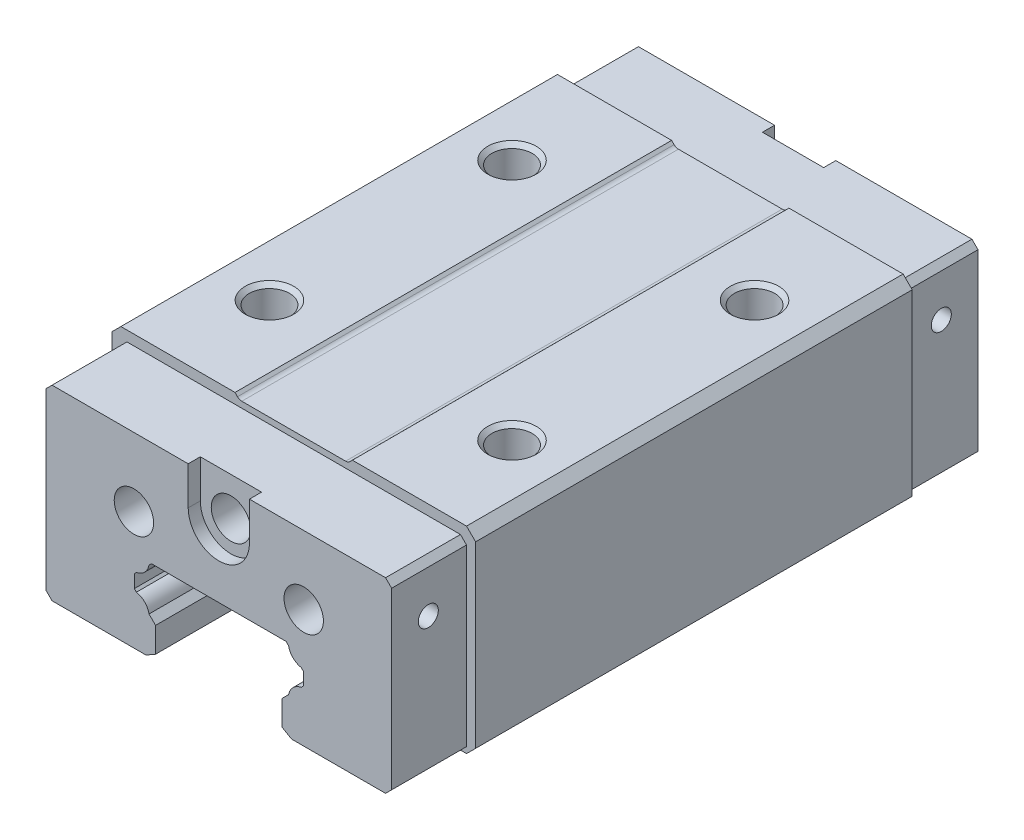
ISO-10303-21;
HEADER;
FILE_DESCRIPTION(('STEP AP214'),'2;1');
FILE_NAME('part.step','',(''),(''),'','','');
FILE_SCHEMA(('AUTOMOTIVE_DESIGN { 1 0 10303 214 1 1 1 1 }'));
ENDSEC;
DATA;
#1=APPLICATION_CONTEXT('core data for automotive mechanical design processes');
#2=APPLICATION_PROTOCOL_DEFINITION('international standard','automotive_design',2000,#1);
#3=PRODUCT_CONTEXT('',#1,'mechanical');
#4=PRODUCT('Part','Part','',(#3));
#5=PRODUCT_RELATED_PRODUCT_CATEGORY('part','',(#4));
#6=PRODUCT_DEFINITION_FORMATION('','',#4);
#7=PRODUCT_DEFINITION_CONTEXT('part definition',#1,'design');
#8=PRODUCT_DEFINITION('design','',#6,#7);
#9=PRODUCT_DEFINITION_SHAPE('','',#8);
#10=(LENGTH_UNIT() NAMED_UNIT(*) SI_UNIT(.MILLI.,.METRE.));
#11=(NAMED_UNIT(*) PLANE_ANGLE_UNIT() SI_UNIT($,.RADIAN.));
#12=(NAMED_UNIT(*) SI_UNIT($,.STERADIAN.) SOLID_ANGLE_UNIT());
#13=UNCERTAINTY_MEASURE_WITH_UNIT(LENGTH_MEASURE(1.E-05),#10,'distance_accuracy_value','');
#14=(GEOMETRIC_REPRESENTATION_CONTEXT(3) GLOBAL_UNCERTAINTY_ASSIGNED_CONTEXT((#13)) GLOBAL_UNIT_ASSIGNED_CONTEXT((#10,
#11,#12)) REPRESENTATION_CONTEXT('',''));
#15=CARTESIAN_POINT('',(0.,0.,0.));
#16=DIRECTION('',(0.,0.,1.));
#17=DIRECTION('',(1.,0.,0.));
#18=AXIS2_PLACEMENT_3D('',#15,#16,#17);
#19=CARTESIAN_POINT('',(-28.5,-32.5,-96.7));
#20=DIRECTION('',(0.,0.,-1.));
#21=DIRECTION('',(0.,1.,0.));
#22=AXIS2_PLACEMENT_3D('',#19,#20,#21);
#23=PLANE('',#22);
#24=DIRECTION('',(0.,-1.,0.));
#25=VECTOR('',#24,1.);
#26=CARTESIAN_POINT('',(-5.04999999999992,-1.7000000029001,-96.7));
#27=LINE('',#26,#25);
#28=CARTESIAN_POINT('',(-5.04999999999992,-1.7000000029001,-96.7));
#29=VERTEX_POINT('',#28);
#30=CARTESIAN_POINT('',(-5.05,-7.99666429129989,-96.7));
#31=VERTEX_POINT('',#30);
#32=EDGE_CURVE('E411',#29,#31,#27,.T.);
#33=ORIENTED_EDGE('',*,*,#32,.T.);
#34=CARTESIAN_POINT('',(0.,-7.996664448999,-96.7));
#35=DIRECTION('',(0.,0.,1.));
#36=DIRECTION('',(-1.,3.12275457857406E-08,0.));
#37=AXIS2_PLACEMENT_3D('',#34,#35,#36);
#38=CIRCLE('',#37,5.05);
#39=CARTESIAN_POINT('',(5.05,-7.99666429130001,-96.7));
#40=VERTEX_POINT('',#39);
#41=EDGE_CURVE('E399',#31,#40,#38,.T.);
#42=ORIENTED_EDGE('',*,*,#41,.T.);
#43=DIRECTION('',(0.,1.,0.));
#44=VECTOR('',#43,1.);
#45=CARTESIAN_POINT('',(5.05,-7.9966642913,-96.7));
#46=LINE('',#45,#44);
#47=CARTESIAN_POINT('',(5.05,-1.7000000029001,-96.7));
#48=VERTEX_POINT('',#47);
#49=EDGE_CURVE('E410',#40,#48,#46,.T.);
#50=ORIENTED_EDGE('',*,*,#49,.T.);
#51=DIRECTION('',(1.,0.,0.));
#52=VECTOR('',#51,1.);
#53=CARTESIAN_POINT('',(5.05,-1.7000000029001,-96.7));
#54=LINE('',#53,#52);
#55=CARTESIAN_POINT('',(27.5,-1.7000000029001,-96.7));
#56=VERTEX_POINT('',#55);
#57=EDGE_CURVE('E432',#56,#48,#54,.F.);
#58=ORIENTED_EDGE('',*,*,#57,.F.);
#59=DIRECTION('',(0.707106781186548,-0.707106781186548,0.));
#60=VECTOR('',#59,1.);
#61=CARTESIAN_POINT('',(27.5,-1.7000000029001,-96.7));
#62=LINE('',#61,#60);
#63=CARTESIAN_POINT('',(28.5,-2.7000000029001,-96.7));
#64=VERTEX_POINT('',#63);
#65=EDGE_CURVE('E437',#64,#56,#62,.F.);
#66=ORIENTED_EDGE('',*,*,#65,.F.);
#67=DIRECTION('',(0.,-1.,0.));
#68=VECTOR('',#67,1.);
#69=CARTESIAN_POINT('',(28.5,-2.7000000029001,-96.7));
#70=LINE('',#69,#68);
#71=CARTESIAN_POINT('',(28.5,-31.5,-96.7));
#72=VERTEX_POINT('',#71);
#73=EDGE_CURVE('E441',#72,#64,#70,.F.);
#74=ORIENTED_EDGE('',*,*,#73,.F.);
#75=DIRECTION('',(-0.707106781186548,-0.707106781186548,0.));
#76=VECTOR('',#75,1.);
#77=CARTESIAN_POINT('',(28.5,-31.5,-96.7));
#78=LINE('',#77,#76);
#79=CARTESIAN_POINT('',(27.5,-32.5,-96.7));
#80=VERTEX_POINT('',#79);
#81=EDGE_CURVE('E445',#80,#72,#78,.F.);
#82=ORIENTED_EDGE('',*,*,#81,.F.);
#83=DIRECTION('',(-1.,0.,0.));
#84=VECTOR('',#83,1.);
#85=CARTESIAN_POINT('',(27.5,-32.5,-96.7));
#86=LINE('',#85,#84);
#87=CARTESIAN_POINT('',(12.0019237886,-32.5,-96.7));
#88=VERTEX_POINT('',#87);
#89=EDGE_CURVE('E449',#88,#80,#86,.F.);
#90=ORIENTED_EDGE('',*,*,#89,.F.);
#91=DIRECTION('',(-0.866025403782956,0.500000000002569,0.));
#92=VECTOR('',#91,1.);
#93=CARTESIAN_POINT('',(12.0019237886,-32.5,-96.7));
#94=LINE('',#93,#92);
#95=CARTESIAN_POINT('',(10.43,-31.5924493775,-96.7));
#96=VERTEX_POINT('',#95);
#97=EDGE_CURVE('E454',#96,#88,#94,.F.);
#98=ORIENTED_EDGE('',*,*,#97,.F.);
#99=DIRECTION('',(0.,1.,0.));
#100=VECTOR('',#99,1.);
#101=CARTESIAN_POINT('',(10.43,-31.5924493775,-96.7));
#102=LINE('',#101,#100);
#103=CARTESIAN_POINT('',(10.43,-27.4694469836,-96.7));
#104=VERTEX_POINT('',#103);
#105=EDGE_CURVE('E458',#104,#96,#102,.F.);
#106=ORIENTED_EDGE('',*,*,#105,.F.);
#107=DIRECTION('',(0.707106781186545,0.70710678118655,0.));
#108=VECTOR('',#107,1.);
#109=CARTESIAN_POINT('',(10.43,-27.4694469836,-96.7));
#110=LINE('',#109,#108);
#111=CARTESIAN_POINT('',(11.511772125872,-26.387674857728,-96.7));
#112=VERTEX_POINT('',#111);
#113=EDGE_CURVE('E463',#112,#104,#110,.F.);
#114=ORIENTED_EDGE('',*,*,#113,.F.);
#115=CARTESIAN_POINT('',(14.0671741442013,-26.8671751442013,-96.7));
#116=DIRECTION('',(0.,0.,-1.));
#117=DIRECTION('',(-0.982846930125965,0.184423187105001,0.));
#118=AXIS2_PLACEMENT_3D('',#115,#116,#117);
#119=CIRCLE('',#118,2.60000000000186);
#120=CARTESIAN_POINT('',(13.587673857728,-24.311773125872,-96.7));
#121=VERTEX_POINT('',#120);
#122=EDGE_CURVE('E468',#121,#112,#119,.F.);
#123=ORIENTED_EDGE('',*,*,#122,.F.);
#124=DIRECTION('',(0.707106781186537,0.707106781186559,0.));
#125=VECTOR('',#124,1.);
#126=CARTESIAN_POINT('',(13.587673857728,-24.311773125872,-96.7));
#127=LINE('',#126,#125);
#128=CARTESIAN_POINT('',(13.929999,-23.9694479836,-96.7));
#129=VERTEX_POINT('',#128);
#130=EDGE_CURVE('E473',#129,#121,#127,.F.);
#131=ORIENTED_EDGE('',*,*,#130,.F.);
#132=DIRECTION('',(0.,1.,0.));
#133=VECTOR('',#132,1.);
#134=CARTESIAN_POINT('',(13.929999,-23.9694479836,-96.7));
#135=LINE('',#134,#133);
#136=CARTESIAN_POINT('',(13.929999,-21.8305520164,-96.7));
#137=VERTEX_POINT('',#136);
#138=EDGE_CURVE('E478',#137,#129,#135,.F.);
#139=ORIENTED_EDGE('',*,*,#138,.F.);
#140=DIRECTION('',(-0.707106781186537,0.707106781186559,0.));
#141=VECTOR('',#140,1.);
#142=CARTESIAN_POINT('',(13.929999,-21.8305520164,-96.7));
#143=LINE('',#142,#141);
#144=CARTESIAN_POINT('',(13.587673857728,-21.488226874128,-96.7));
#145=VERTEX_POINT('',#144);
#146=EDGE_CURVE('E483',#145,#137,#143,.F.);
#147=ORIENTED_EDGE('',*,*,#146,.F.);
#148=CARTESIAN_POINT('',(14.0671741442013,-18.9328248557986,-96.7));
#149=DIRECTION('',(0.,0.,-1.));
#150=DIRECTION('',(-0.184423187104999,-0.982846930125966,0.));
#151=AXIS2_PLACEMENT_3D('',#148,#149,#150);
#152=CIRCLE('',#151,2.60000000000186);
#153=CARTESIAN_POINT('',(11.511772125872,-19.412325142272,-96.7));
#154=VERTEX_POINT('',#153);
#155=EDGE_CURVE('E488',#154,#145,#152,.F.);
#156=ORIENTED_EDGE('',*,*,#155,.F.);
#157=DIRECTION('',(-0.707106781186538,0.707106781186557,0.));
#158=VECTOR('',#157,1.);
#159=CARTESIAN_POINT('',(11.511772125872,-19.412325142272,-96.7));
#160=LINE('',#159,#158);
#161=CARTESIAN_POINT('',(11.0994469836,-19.,-96.7));
#162=VERTEX_POINT('',#161);
#163=EDGE_CURVE('E493',#162,#154,#160,.F.);
#164=ORIENTED_EDGE('',*,*,#163,.F.);
#165=DIRECTION('',(-1.,0.,0.));
#166=VECTOR('',#165,1.);
#167=CARTESIAN_POINT('',(11.0994469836,-19.,-96.7));
#168=LINE('',#167,#166);
#169=CARTESIAN_POINT('',(-11.0994469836,-19.,-96.7));
#170=VERTEX_POINT('',#169);
#171=EDGE_CURVE('E498',#170,#162,#168,.F.);
#172=ORIENTED_EDGE('',*,*,#171,.F.);
#173=DIRECTION('',(-0.707106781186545,-0.707106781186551,0.));
#174=VECTOR('',#173,1.);
#175=CARTESIAN_POINT('',(-11.0994469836,-19.,-96.7));
#176=LINE('',#175,#174);
#177=CARTESIAN_POINT('',(-11.511772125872,-19.412325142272,-96.7));
#178=VERTEX_POINT('',#177);
#179=EDGE_CURVE('E503',#178,#170,#176,.F.);
#180=ORIENTED_EDGE('',*,*,#179,.F.);
#181=CARTESIAN_POINT('',(-14.0671741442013,-18.9328248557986,-96.7));
#182=DIRECTION('',(0.,0.,-1.));
#183=DIRECTION('',(0.982846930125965,-0.184423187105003,0.));
#184=AXIS2_PLACEMENT_3D('',#181,#182,#183);
#185=CIRCLE('',#184,2.60000000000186);
#186=CARTESIAN_POINT('',(-13.587673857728,-21.488226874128,-96.7));
#187=VERTEX_POINT('',#186);
#188=EDGE_CURVE('E508',#187,#178,#185,.F.);
#189=ORIENTED_EDGE('',*,*,#188,.F.);
#190=DIRECTION('',(-0.707106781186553,-0.707106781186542,0.));
#191=VECTOR('',#190,1.);
#192=CARTESIAN_POINT('',(-13.587673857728,-21.488226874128,-96.7));
#193=LINE('',#192,#191);
#194=CARTESIAN_POINT('',(-13.929999,-21.8305520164,-96.7));
#195=VERTEX_POINT('',#194);
#196=EDGE_CURVE('E513',#195,#187,#193,.F.);
#197=ORIENTED_EDGE('',*,*,#196,.F.);
#198=DIRECTION('',(0.,-1.,0.));
#199=VECTOR('',#198,1.);
#200=CARTESIAN_POINT('',(-13.929999,-21.8305520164,-96.7));
#201=LINE('',#200,#199);
#202=CARTESIAN_POINT('',(-13.929999,-23.9694479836,-96.7));
#203=VERTEX_POINT('',#202);
#204=EDGE_CURVE('E518',#203,#195,#201,.F.);
#205=ORIENTED_EDGE('',*,*,#204,.F.);
#206=DIRECTION('',(0.707106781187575,-0.70710678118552,0.));
#207=VECTOR('',#206,1.);
#208=CARTESIAN_POINT('',(-13.929999,-23.9694479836,-96.7));
#209=LINE('',#208,#207);
#210=CARTESIAN_POINT('',(-13.587673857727,-24.311773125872,-96.7));
#211=VERTEX_POINT('',#210);
#212=EDGE_CURVE('E523',#211,#203,#209,.F.);
#213=ORIENTED_EDGE('',*,*,#212,.F.);
#214=CARTESIAN_POINT('',(-14.0671741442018,-26.8671751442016,-96.7));
#215=DIRECTION('',(0.,0.,-1.));
#216=DIRECTION('',(0.18442318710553,0.982846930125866,0.));
#217=AXIS2_PLACEMENT_3D('',#214,#215,#216);
#218=CIRCLE('',#217,2.60000000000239);
#219=CARTESIAN_POINT('',(-11.511772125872,-26.387674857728,-96.7));
#220=VERTEX_POINT('',#219);
#221=EDGE_CURVE('E528',#220,#211,#218,.F.);
#222=ORIENTED_EDGE('',*,*,#221,.F.);
#223=DIRECTION('',(0.707106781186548,-0.707106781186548,0.));
#224=VECTOR('',#223,1.);
#225=CARTESIAN_POINT('',(-11.511772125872,-26.387674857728,-96.7));
#226=LINE('',#225,#224);
#227=CARTESIAN_POINT('',(-10.43,-27.4694469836,-96.7));
#228=VERTEX_POINT('',#227);
#229=EDGE_CURVE('E533',#228,#220,#226,.F.);
#230=ORIENTED_EDGE('',*,*,#229,.F.);
#231=DIRECTION('',(0.,-1.,0.));
#232=VECTOR('',#231,1.);
#233=CARTESIAN_POINT('',(-10.43,-27.4694469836,-96.7));
#234=LINE('',#233,#232);
#235=CARTESIAN_POINT('',(-10.43,-31.5924493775,-96.7));
#236=VERTEX_POINT('',#235);
#237=EDGE_CURVE('E538',#236,#228,#234,.F.);
#238=ORIENTED_EDGE('',*,*,#237,.F.);
#239=DIRECTION('',(-0.866025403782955,-0.500000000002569,0.));
#240=VECTOR('',#239,1.);
#241=CARTESIAN_POINT('',(-10.43,-31.5924493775,-96.7));
#242=LINE('',#241,#240);
#243=CARTESIAN_POINT('',(-12.0019237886,-32.5,-96.7));
#244=VERTEX_POINT('',#243);
#245=EDGE_CURVE('E543',#244,#236,#242,.F.);
#246=ORIENTED_EDGE('',*,*,#245,.F.);
#247=DIRECTION('',(-1.,0.,0.));
#248=VECTOR('',#247,1.);
#249=CARTESIAN_POINT('',(-12.0019237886,-32.5,-96.7));
#250=LINE('',#249,#248);
#251=CARTESIAN_POINT('',(-27.5,-32.5,-96.7));
#252=VERTEX_POINT('',#251);
#253=EDGE_CURVE('E548',#252,#244,#250,.F.);
#254=ORIENTED_EDGE('',*,*,#253,.F.);
#255=DIRECTION('',(-0.707106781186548,0.707106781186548,0.));
#256=VECTOR('',#255,1.);
#257=CARTESIAN_POINT('',(-27.5,-32.5,-96.7));
#258=LINE('',#257,#256);
#259=CARTESIAN_POINT('',(-28.5,-31.5,-96.7));
#260=VERTEX_POINT('',#259);
#261=EDGE_CURVE('E553',#260,#252,#258,.F.);
#262=ORIENTED_EDGE('',*,*,#261,.F.);
#263=DIRECTION('',(0.,1.,0.));
#264=VECTOR('',#263,1.);
#265=CARTESIAN_POINT('',(-28.5,-31.5,-96.7));
#266=LINE('',#265,#264);
#267=CARTESIAN_POINT('',(-28.5,-2.7000000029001,-96.7));
#268=VERTEX_POINT('',#267);
#269=EDGE_CURVE('E557',#268,#260,#266,.F.);
#270=ORIENTED_EDGE('',*,*,#269,.F.);
#271=DIRECTION('',(0.707106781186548,0.707106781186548,0.));
#272=VECTOR('',#271,1.);
#273=CARTESIAN_POINT('',(-28.5,-2.7000000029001,-96.7));
#274=LINE('',#273,#272);
#275=CARTESIAN_POINT('',(-27.5,-1.7000000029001,-96.7));
#276=VERTEX_POINT('',#275);
#277=EDGE_CURVE('E561',#276,#268,#274,.F.);
#278=ORIENTED_EDGE('',*,*,#277,.F.);
#279=DIRECTION('',(1.,0.,0.));
#280=VECTOR('',#279,1.);
#281=CARTESIAN_POINT('',(-27.5,-1.7000000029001,-96.7));
#282=LINE('',#281,#280);
#283=EDGE_CURVE('E424',#29,#276,#282,.F.);
#284=ORIENTED_EDGE('',*,*,#283,.F.);
#285=EDGE_LOOP('',(#33,#42,#50,#58,#66,#74,#82,#90,#98,#106,#114,#123,#131,#139,#147,#156,#164,
#172,#180,#189,#197,#205,#213,#222,#230,#238,#246,#254,#262,#270,#278,#284));
#286=FACE_BOUND('',#285,.T.);
#287=CARTESIAN_POINT('',(-14.,-13.,-96.7));
#288=DIRECTION('',(0.,0.,1.));
#289=DIRECTION('',(-1.,0.,0.));
#290=AXIS2_PLACEMENT_3D('',#287,#288,#289);
#291=CIRCLE('',#290,3.25);
#292=CARTESIAN_POINT('',(-17.25,-13.,-96.7));
#293=VERTEX_POINT('',#292);
#294=EDGE_CURVE('E569',#293,#293,#291,.T.);
#295=ORIENTED_EDGE('',*,*,#294,.T.);
#296=EDGE_LOOP('',(#295));
#297=FACE_BOUND('',#296,.T.);
#298=CARTESIAN_POINT('',(14.,-13.,-96.7));
#299=DIRECTION('',(0.,0.,1.));
#300=DIRECTION('',(-1.,0.,0.));
#301=AXIS2_PLACEMENT_3D('',#298,#299,#300);
#302=CIRCLE('',#301,3.25);
#303=CARTESIAN_POINT('',(10.75,-13.,-96.7));
#304=VERTEX_POINT('',#303);
#305=EDGE_CURVE('E574',#304,#304,#302,.T.);
#306=ORIENTED_EDGE('',*,*,#305,.T.);
#307=EDGE_LOOP('',(#306));
#308=FACE_BOUND('',#307,.T.);
#309=ADVANCED_FACE('F17',(#286,#297,#308),#23,.T.);
#310=CARTESIAN_POINT('',(-27.5,-1.7000000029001,-84.35));
#311=DIRECTION('',(0.,1.,0.));
#312=DIRECTION('',(1.,0.,0.));
#313=AXIS2_PLACEMENT_3D('',#310,#311,#312);
#314=PLANE('',#313);
#315=DIRECTION('',(0.,0.,-1.));
#316=VECTOR('',#315,1.);
#317=CARTESIAN_POINT('',(-5.04999999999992,-1.7000000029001,-94.7));
#318=LINE('',#317,#316);
#319=CARTESIAN_POINT('',(-5.04999999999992,-1.7000000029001,-94.7));
#320=VERTEX_POINT('',#319);
#321=EDGE_CURVE('E577',#29,#320,#318,.F.);
#322=ORIENTED_EDGE('',*,*,#321,.F.);
#323=ORIENTED_EDGE('',*,*,#283,.T.);
#324=DIRECTION('',(0.,0.,1.));
#325=VECTOR('',#324,1.);
#326=CARTESIAN_POINT('',(-27.5,-1.7000000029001,-96.7));
#327=LINE('',#326,#325);
#328=CARTESIAN_POINT('',(-27.5,-1.7000000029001,-84.35));
#329=VERTEX_POINT('',#328);
#330=EDGE_CURVE('E579',#329,#276,#327,.F.);
#331=ORIENTED_EDGE('',*,*,#330,.F.);
#332=DIRECTION('',(1.,0.,0.));
#333=VECTOR('',#332,1.);
#334=CARTESIAN_POINT('',(-27.5,-1.7000000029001,-84.35));
#335=LINE('',#334,#333);
#336=CARTESIAN_POINT('',(27.5,-1.7000000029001,-84.35));
#337=VERTEX_POINT('',#336);
#338=EDGE_CURVE('E583',#337,#329,#335,.F.);
#339=ORIENTED_EDGE('',*,*,#338,.F.);
#340=DIRECTION('',(0.,0.,-1.));
#341=VECTOR('',#340,1.);
#342=CARTESIAN_POINT('',(27.5,-1.7000000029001,-84.35));
#343=LINE('',#342,#341);
#344=EDGE_CURVE('E587',#337,#56,#343,.T.);
#345=ORIENTED_EDGE('',*,*,#344,.T.);
#346=ORIENTED_EDGE('',*,*,#57,.T.);
#347=DIRECTION('',(0.,0.,1.));
#348=VECTOR('',#347,1.);
#349=CARTESIAN_POINT('',(5.05,-1.7000000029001,-96.7));
#350=LINE('',#349,#348);
#351=CARTESIAN_POINT('',(5.05,-1.7000000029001,-94.7));
#352=VERTEX_POINT('',#351);
#353=EDGE_CURVE('E592',#352,#48,#350,.F.);
#354=ORIENTED_EDGE('',*,*,#353,.F.);
#355=DIRECTION('',(-1.,0.,0.));
#356=VECTOR('',#355,1.);
#357=CARTESIAN_POINT('',(5.05,-1.7000000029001,-94.7));
#358=LINE('',#357,#356);
#359=EDGE_CURVE('E596',#352,#320,#358,.T.);
#360=ORIENTED_EDGE('',*,*,#359,.T.);
#361=EDGE_LOOP('',(#322,#323,#331,#339,#345,#346,#354,#360));
#362=FACE_BOUND('',#361,.T.);
#363=ADVANCED_FACE('F1367',(#362),#314,.T.);
#364=CARTESIAN_POINT('',(-28.5,0.,-84.35));
#365=DIRECTION('',(-0.707106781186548,0.707106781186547,0.));
#366=DIRECTION('',(-0.707106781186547,-0.707106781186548,0.));
#367=AXIS2_PLACEMENT_3D('',#364,#365,#366);
#368=PLANE('',#367);
#369=DIRECTION('',(-0.707106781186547,-0.707106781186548,0.));
#370=VECTOR('',#369,1.);
#371=CARTESIAN_POINT('',(-28.5,0.,-84.35));
#372=LINE('',#371,#370);
#373=CARTESIAN_POINT('',(-30.,-1.5,-84.35));
#374=VERTEX_POINT('',#373);
#375=CARTESIAN_POINT('',(-28.5,0.,-84.35));
#376=VERTEX_POINT('',#375);
#377=EDGE_CURVE('E601',#374,#376,#372,.F.);
#378=ORIENTED_EDGE('',*,*,#377,.F.);
#379=DIRECTION('',(0.,0.,1.));
#380=VECTOR('',#379,1.);
#381=CARTESIAN_POINT('',(-30.,-1.5,-84.35));
#382=LINE('',#381,#380);
#383=CARTESIAN_POINT('',(-30.,-1.5,-12.35));
#384=VERTEX_POINT('',#383);
#385=EDGE_CURVE('E605',#374,#384,#382,.T.);
#386=ORIENTED_EDGE('',*,*,#385,.T.);
#387=DIRECTION('',(0.707106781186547,0.707106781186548,0.));
#388=VECTOR('',#387,1.);
#389=CARTESIAN_POINT('',(-30.,-1.5,-12.35));
#390=LINE('',#389,#388);
#391=CARTESIAN_POINT('',(-28.5,0.,-12.35));
#392=VERTEX_POINT('',#391);
#393=EDGE_CURVE('E610',#384,#392,#390,.T.);
#394=ORIENTED_EDGE('',*,*,#393,.T.);
#395=DIRECTION('',(0.,0.,-1.));
#396=VECTOR('',#395,1.);
#397=CARTESIAN_POINT('',(-28.5,0.,-12.35));
#398=LINE('',#397,#396);
#399=EDGE_CURVE('E615',#376,#392,#398,.F.);
#400=ORIENTED_EDGE('',*,*,#399,.F.);
#401=EDGE_LOOP('',(#378,#386,#394,#400));
#402=FACE_BOUND('',#401,.T.);
#403=ADVANCED_FACE('F1372',(#402),#368,.T.);
#404=CARTESIAN_POINT('',(-30.,-8.,-84.35));
#405=DIRECTION('',(-1.,0.,0.));
#406=DIRECTION('',(0.,0.,1.));
#407=AXIS2_PLACEMENT_3D('',#404,#405,#406);
#408=PLANE('',#407);
#409=DIRECTION('',(0.,-1.,0.));
#410=VECTOR('',#409,1.);
#411=CARTESIAN_POINT('',(-30.,-1.5,-84.35));
#412=LINE('',#411,#410);
#413=CARTESIAN_POINT('',(-30.,-8.,-84.35));
#414=VERTEX_POINT('',#413);
#415=EDGE_CURVE('E620',#414,#374,#412,.F.);
#416=ORIENTED_EDGE('',*,*,#415,.F.);
#417=DIRECTION('',(0.,0.,1.));
#418=VECTOR('',#417,1.);
#419=CARTESIAN_POINT('',(-30.,-8.,-84.35));
#420=LINE('',#419,#418);
#421=CARTESIAN_POINT('',(-30.,-8.,-12.35));
#422=VERTEX_POINT('',#421);
#423=EDGE_CURVE('E624',#414,#422,#420,.T.);
#424=ORIENTED_EDGE('',*,*,#423,.T.);
#425=DIRECTION('',(0.,1.,0.));
#426=VECTOR('',#425,1.);
#427=CARTESIAN_POINT('',(-30.,-8.,-12.35));
#428=LINE('',#427,#426);
#429=EDGE_CURVE('E629',#422,#384,#428,.T.);
#430=ORIENTED_EDGE('',*,*,#429,.T.);
#431=ORIENTED_EDGE('',*,*,#385,.F.);
#432=EDGE_LOOP('',(#416,#424,#430,#431));
#433=FACE_BOUND('',#432,.T.);
#434=ADVANCED_FACE('F1378',(#433),#408,.T.);
#435=CARTESIAN_POINT('',(-30.,-8.,-84.35));
#436=DIRECTION('',(-0.707106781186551,-0.707106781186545,0.));
#437=DIRECTION('',(0.707106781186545,-0.707106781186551,0.));
#438=AXIS2_PLACEMENT_3D('',#435,#436,#437);
#439=PLANE('',#438);
#440=DIRECTION('',(0.707106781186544,-0.707106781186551,0.));
#441=VECTOR('',#440,1.);
#442=CARTESIAN_POINT('',(-30.,-8.,-84.35));
#443=LINE('',#442,#441);
#444=CARTESIAN_POINT('',(-29.6,-8.4,-84.35));
#445=VERTEX_POINT('',#444);
#446=EDGE_CURVE('E634',#445,#414,#443,.F.);
#447=ORIENTED_EDGE('',*,*,#446,.F.);
#448=DIRECTION('',(0.,0.,1.));
#449=VECTOR('',#448,1.);
#450=CARTESIAN_POINT('',(-29.6,-8.4,-84.35));
#451=LINE('',#450,#449);
#452=CARTESIAN_POINT('',(-29.6,-8.4,-12.35));
#453=VERTEX_POINT('',#452);
#454=EDGE_CURVE('E638',#445,#453,#451,.T.);
#455=ORIENTED_EDGE('',*,*,#454,.T.);
#456=DIRECTION('',(-0.707106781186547,0.707106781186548,0.));
#457=VECTOR('',#456,1.);
#458=CARTESIAN_POINT('',(-29.6,-8.4,-12.35));
#459=LINE('',#458,#457);
#460=EDGE_CURVE('E643',#453,#422,#459,.T.);
#461=ORIENTED_EDGE('',*,*,#460,.T.);
#462=ORIENTED_EDGE('',*,*,#423,.F.);
#463=EDGE_LOOP('',(#447,#455,#461,#462));
#464=FACE_BOUND('',#463,.T.);
#465=ADVANCED_FACE('F1382',(#464),#439,.T.);
#466=CARTESIAN_POINT('',(-29.6,-31.4,-84.35));
#467=DIRECTION('',(-1.,0.,0.));
#468=DIRECTION('',(0.,0.,1.));
#469=AXIS2_PLACEMENT_3D('',#466,#467,#468);
#470=PLANE('',#469);
#471=DIRECTION('',(0.,-1.,0.));
#472=VECTOR('',#471,1.);
#473=CARTESIAN_POINT('',(-29.6,-8.4,-84.35));
#474=LINE('',#473,#472);
#475=CARTESIAN_POINT('',(-29.6,-31.4,-84.35));
#476=VERTEX_POINT('',#475);
#477=EDGE_CURVE('E648',#476,#445,#474,.F.);
#478=ORIENTED_EDGE('',*,*,#477,.F.);
#479=DIRECTION('',(0.,0.,1.));
#480=VECTOR('',#479,1.);
#481=CARTESIAN_POINT('',(-29.6,-31.4,-84.35));
#482=LINE('',#481,#480);
#483=CARTESIAN_POINT('',(-29.6,-31.4,-12.35));
#484=VERTEX_POINT('',#483);
#485=EDGE_CURVE('E652',#476,#484,#482,.T.);
#486=ORIENTED_EDGE('',*,*,#485,.T.);
#487=DIRECTION('',(0.,1.,0.));
#488=VECTOR('',#487,1.);
#489=CARTESIAN_POINT('',(-29.6,-31.4,-12.35));
#490=LINE('',#489,#488);
#491=EDGE_CURVE('E657',#484,#453,#490,.T.);
#492=ORIENTED_EDGE('',*,*,#491,.T.);
#493=ORIENTED_EDGE('',*,*,#454,.F.);
#494=EDGE_LOOP('',(#478,#486,#492,#493));
#495=FACE_BOUND('',#494,.T.);
#496=ADVANCED_FACE('F1386',(#495),#470,.T.);
#497=CARTESIAN_POINT('',(-29.6,-31.4,-84.35));
#498=DIRECTION('',(-0.707106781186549,-0.707106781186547,0.));
#499=DIRECTION('',(0.707106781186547,-0.707106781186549,0.));
#500=AXIS2_PLACEMENT_3D('',#497,#498,#499);
#501=PLANE('',#500);
#502=DIRECTION('',(0.707106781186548,-0.707106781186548,0.));
#503=VECTOR('',#502,1.);
#504=CARTESIAN_POINT('',(-29.6,-31.4,-84.35));
#505=LINE('',#504,#503);
#506=CARTESIAN_POINT('',(-28.5,-32.5,-84.35));
#507=VERTEX_POINT('',#506);
#508=EDGE_CURVE('E662',#507,#476,#505,.F.);
#509=ORIENTED_EDGE('',*,*,#508,.F.);
#510=DIRECTION('',(0.,0.,1.));
#511=VECTOR('',#510,1.);
#512=CARTESIAN_POINT('',(-28.5,-32.5,-84.35));
#513=LINE('',#512,#511);
#514=CARTESIAN_POINT('',(-28.5,-32.5,-12.35));
#515=VERTEX_POINT('',#514);
#516=EDGE_CURVE('E666',#507,#515,#513,.T.);
#517=ORIENTED_EDGE('',*,*,#516,.T.);
#518=DIRECTION('',(-0.707106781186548,0.707106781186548,0.));
#519=VECTOR('',#518,1.);
#520=CARTESIAN_POINT('',(-28.5,-32.5,-12.35));
#521=LINE('',#520,#519);
#522=EDGE_CURVE('E671',#515,#484,#521,.T.);
#523=ORIENTED_EDGE('',*,*,#522,.T.);
#524=ORIENTED_EDGE('',*,*,#485,.F.);
#525=EDGE_LOOP('',(#509,#517,#523,#524));
#526=FACE_BOUND('',#525,.T.);
#527=ADVANCED_FACE('F1390',(#526),#501,.T.);
#528=CARTESIAN_POINT('',(-28.5,-32.5,0.));
#529=DIRECTION('',(0.,-1.,0.));
#530=DIRECTION('',(0.,0.,-1.));
#531=AXIS2_PLACEMENT_3D('',#528,#529,#530);
#532=PLANE('',#531);
#533=DIRECTION('',(1.,0.,0.));
#534=VECTOR('',#533,1.);
#535=CARTESIAN_POINT('',(-28.5,-32.5,-84.35));
#536=LINE('',#535,#534);
#537=CARTESIAN_POINT('',(-27.5,-32.5,-84.35));
#538=VERTEX_POINT('',#537);
#539=EDGE_CURVE('E676',#538,#507,#536,.F.);
#540=ORIENTED_EDGE('',*,*,#539,.F.);
#541=DIRECTION('',(0.,0.,-1.));
#542=VECTOR('',#541,1.);
#543=CARTESIAN_POINT('',(-27.5,-32.5,-84.35));
#544=LINE('',#543,#542);
#545=EDGE_CURVE('E680',#538,#252,#544,.T.);
#546=ORIENTED_EDGE('',*,*,#545,.T.);
#547=ORIENTED_EDGE('',*,*,#253,.T.);
#548=DIRECTION('',(0.,0.,1.));
#549=VECTOR('',#548,1.);
#550=CARTESIAN_POINT('',(-12.0019237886,-32.5,-96.7));
#551=LINE('',#550,#549);
#552=CARTESIAN_POINT('',(-12.0019237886,-32.5,0.));
#553=VERTEX_POINT('',#552);
#554=EDGE_CURVE('E685',#244,#553,#551,.T.);
#555=ORIENTED_EDGE('',*,*,#554,.T.);
#556=DIRECTION('',(-1.,0.,0.));
#557=VECTOR('',#556,1.);
#558=CARTESIAN_POINT('',(-12.0019237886,-32.5,0.));
#559=LINE('',#558,#557);
#560=CARTESIAN_POINT('',(-27.5,-32.5,0.));
#561=VERTEX_POINT('',#560);
#562=EDGE_CURVE('E690',#561,#553,#559,.F.);
#563=ORIENTED_EDGE('',*,*,#562,.F.);
#564=DIRECTION('',(0.,0.,-1.));
#565=VECTOR('',#564,1.);
#566=CARTESIAN_POINT('',(-27.5,-32.5,0.));
#567=LINE('',#566,#565);
#568=CARTESIAN_POINT('',(-27.5,-32.5,-12.35));
#569=VERTEX_POINT('',#568);
#570=EDGE_CURVE('E695',#569,#561,#567,.F.);
#571=ORIENTED_EDGE('',*,*,#570,.F.);
#572=DIRECTION('',(-1.,0.,0.));
#573=VECTOR('',#572,1.);
#574=CARTESIAN_POINT('',(-27.5,-32.5,-12.35));
#575=LINE('',#574,#573);
#576=EDGE_CURVE('E699',#569,#515,#575,.T.);
#577=ORIENTED_EDGE('',*,*,#576,.T.);
#578=ORIENTED_EDGE('',*,*,#516,.F.);
#579=EDGE_LOOP('',(#540,#546,#547,#555,#563,#571,#577,#578));
#580=FACE_BOUND('',#579,.T.);
#581=ADVANCED_FACE('F1394',(#580),#532,.T.);
#582=CARTESIAN_POINT('',(12.0019237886,-32.5,0.));
#583=DIRECTION('',(0.,-1.,0.));
#584=DIRECTION('',(0.,0.,-1.));
#585=AXIS2_PLACEMENT_3D('',#582,#583,#584);
#586=PLANE('',#585);
#587=DIRECTION('',(1.,0.,0.));
#588=VECTOR('',#587,1.);
#589=CARTESIAN_POINT('',(27.5,-32.5,-84.35));
#590=LINE('',#589,#588);
#591=CARTESIAN_POINT('',(28.5,-32.5,-84.35));
#592=VERTEX_POINT('',#591);
#593=CARTESIAN_POINT('',(27.5,-32.5,-84.35));
#594=VERTEX_POINT('',#593);
#595=EDGE_CURVE('E704',#592,#594,#590,.F.);
#596=ORIENTED_EDGE('',*,*,#595,.F.);
#597=DIRECTION('',(0.,0.,1.));
#598=VECTOR('',#597,1.);
#599=CARTESIAN_POINT('',(28.5,-32.5,-84.35));
#600=LINE('',#599,#598);
#601=CARTESIAN_POINT('',(28.5,-32.5,-12.35));
#602=VERTEX_POINT('',#601);
#603=EDGE_CURVE('E708',#592,#602,#600,.T.);
#604=ORIENTED_EDGE('',*,*,#603,.T.);
#605=DIRECTION('',(-1.,0.,0.));
#606=VECTOR('',#605,1.);
#607=CARTESIAN_POINT('',(28.5,-32.5,-12.35));
#608=LINE('',#607,#606);
#609=CARTESIAN_POINT('',(27.5,-32.5,-12.35));
#610=VERTEX_POINT('',#609);
#611=EDGE_CURVE('E713',#602,#610,#608,.T.);
#612=ORIENTED_EDGE('',*,*,#611,.T.);
#613=DIRECTION('',(0.,0.,1.));
#614=VECTOR('',#613,1.);
#615=CARTESIAN_POINT('',(27.5,-32.5,-12.35));
#616=LINE('',#615,#614);
#617=CARTESIAN_POINT('',(27.5,-32.5,0.));
#618=VERTEX_POINT('',#617);
#619=EDGE_CURVE('E718',#610,#618,#616,.T.);
#620=ORIENTED_EDGE('',*,*,#619,.T.);
#621=DIRECTION('',(-1.,0.,0.));
#622=VECTOR('',#621,1.);
#623=CARTESIAN_POINT('',(27.5,-32.5,0.));
#624=LINE('',#623,#622);
#625=CARTESIAN_POINT('',(12.0019237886,-32.5,0.));
#626=VERTEX_POINT('',#625);
#627=EDGE_CURVE('E723',#626,#618,#624,.F.);
#628=ORIENTED_EDGE('',*,*,#627,.F.);
#629=DIRECTION('',(0.,0.,-1.));
#630=VECTOR('',#629,1.);
#631=CARTESIAN_POINT('',(12.0019237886,-32.5,0.));
#632=LINE('',#631,#630);
#633=EDGE_CURVE('E728',#88,#626,#632,.F.);
#634=ORIENTED_EDGE('',*,*,#633,.F.);
#635=ORIENTED_EDGE('',*,*,#89,.T.);
#636=DIRECTION('',(0.,0.,1.));
#637=VECTOR('',#636,1.);
#638=CARTESIAN_POINT('',(27.5,-32.5,-96.7));
#639=LINE('',#638,#637);
#640=EDGE_CURVE('E732',#594,#80,#639,.F.);
#641=ORIENTED_EDGE('',*,*,#640,.F.);
#642=EDGE_LOOP('',(#596,#604,#612,#620,#628,#634,#635,#641));
#643=FACE_BOUND('',#642,.T.);
#644=ADVANCED_FACE('F1398',(#643),#586,.T.);
#645=CARTESIAN_POINT('',(28.5,-32.5,-84.35));
#646=DIRECTION('',(0.707106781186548,-0.707106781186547,0.));
#647=DIRECTION('',(0.707106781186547,0.707106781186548,0.));
#648=AXIS2_PLACEMENT_3D('',#645,#646,#647);
#649=PLANE('',#648);
#650=DIRECTION('',(0.707106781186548,0.707106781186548,0.));
#651=VECTOR('',#650,1.);
#652=CARTESIAN_POINT('',(28.5,-32.5,-84.35));
#653=LINE('',#652,#651);
#654=CARTESIAN_POINT('',(30.,-31.,-84.35));
#655=VERTEX_POINT('',#654);
#656=EDGE_CURVE('E736',#655,#592,#653,.F.);
#657=ORIENTED_EDGE('',*,*,#656,.F.);
#658=DIRECTION('',(0.,0.,1.));
#659=VECTOR('',#658,1.);
#660=CARTESIAN_POINT('',(30.,-31.,-84.35));
#661=LINE('',#660,#659);
#662=CARTESIAN_POINT('',(30.,-31.,-12.35));
#663=VERTEX_POINT('',#662);
#664=EDGE_CURVE('E740',#655,#663,#661,.T.);
#665=ORIENTED_EDGE('',*,*,#664,.T.);
#666=DIRECTION('',(-0.707106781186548,-0.707106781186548,0.));
#667=VECTOR('',#666,1.);
#668=CARTESIAN_POINT('',(30.,-31.,-12.35));
#669=LINE('',#668,#667);
#670=EDGE_CURVE('E745',#663,#602,#669,.T.);
#671=ORIENTED_EDGE('',*,*,#670,.T.);
#672=ORIENTED_EDGE('',*,*,#603,.F.);
#673=EDGE_LOOP('',(#657,#665,#671,#672));
#674=FACE_BOUND('',#673,.T.);
#675=ADVANCED_FACE('F1402',(#674),#649,.T.);
#676=CARTESIAN_POINT('',(30.,-31.,-12.35));
#677=DIRECTION('',(1.,0.,0.));
#678=DIRECTION('',(0.,0.,-1.));
#679=AXIS2_PLACEMENT_3D('',#676,#677,#678);
#680=PLANE('',#679);
#681=DIRECTION('',(0.,1.,0.));
#682=VECTOR('',#681,1.);
#683=CARTESIAN_POINT('',(30.,-31.,-84.35));
#684=LINE('',#683,#682);
#685=CARTESIAN_POINT('',(30.,-1.5,-84.35));
#686=VERTEX_POINT('',#685);
#687=EDGE_CURVE('E750',#686,#655,#684,.F.);
#688=ORIENTED_EDGE('',*,*,#687,.F.);
#689=DIRECTION('',(0.,0.,1.));
#690=VECTOR('',#689,1.);
#691=CARTESIAN_POINT('',(30.,-1.5,-84.35));
#692=LINE('',#691,#690);
#693=CARTESIAN_POINT('',(30.,-1.5,-12.35));
#694=VERTEX_POINT('',#693);
#695=EDGE_CURVE('E754',#686,#694,#692,.T.);
#696=ORIENTED_EDGE('',*,*,#695,.T.);
#697=DIRECTION('',(0.,-1.,0.));
#698=VECTOR('',#697,1.);
#699=CARTESIAN_POINT('',(30.,-1.5,-12.35));
#700=LINE('',#699,#698);
#701=EDGE_CURVE('E759',#694,#663,#700,.T.);
#702=ORIENTED_EDGE('',*,*,#701,.T.);
#703=ORIENTED_EDGE('',*,*,#664,.F.);
#704=EDGE_LOOP('',(#688,#696,#702,#703));
#705=FACE_BOUND('',#704,.T.);
#706=ADVANCED_FACE('F1406',(#705),#680,.T.);
#707=CARTESIAN_POINT('',(30.,-1.5,-84.35));
#708=DIRECTION('',(0.707106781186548,0.707106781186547,0.));
#709=DIRECTION('',(-0.707106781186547,0.707106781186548,0.));
#710=AXIS2_PLACEMENT_3D('',#707,#708,#709);
#711=PLANE('',#710);
#712=DIRECTION('',(-0.707106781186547,0.707106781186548,0.));
#713=VECTOR('',#712,1.);
#714=CARTESIAN_POINT('',(30.,-1.5,-84.35));
#715=LINE('',#714,#713);
#716=CARTESIAN_POINT('',(28.5,0.,-84.35));
#717=VERTEX_POINT('',#716);
#718=EDGE_CURVE('E764',#717,#686,#715,.F.);
#719=ORIENTED_EDGE('',*,*,#718,.F.);
#720=DIRECTION('',(0.,0.,1.));
#721=VECTOR('',#720,1.);
#722=CARTESIAN_POINT('',(28.5,0.,-84.35));
#723=LINE('',#722,#721);
#724=CARTESIAN_POINT('',(28.5,0.,-12.35));
#725=VERTEX_POINT('',#724);
#726=EDGE_CURVE('E768',#717,#725,#723,.T.);
#727=ORIENTED_EDGE('',*,*,#726,.T.);
#728=DIRECTION('',(0.707106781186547,-0.707106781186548,0.));
#729=VECTOR('',#728,1.);
#730=CARTESIAN_POINT('',(28.5,0.,-12.35));
#731=LINE('',#730,#729);
#732=EDGE_CURVE('E773',#725,#694,#731,.T.);
#733=ORIENTED_EDGE('',*,*,#732,.T.);
#734=ORIENTED_EDGE('',*,*,#695,.F.);
#735=EDGE_LOOP('',(#719,#727,#733,#734));
#736=FACE_BOUND('',#735,.T.);
#737=ADVANCED_FACE('F1410',(#736),#711,.T.);
#738=CARTESIAN_POINT('',(9.6757359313,0.,-84.35));
#739=DIRECTION('',(0.,1.,0.));
#740=DIRECTION('',(0.,0.,1.));
#741=AXIS2_PLACEMENT_3D('',#738,#739,#740);
#742=PLANE('',#741);
#743=DIRECTION('',(-1.,0.,0.));
#744=VECTOR('',#743,1.);
#745=CARTESIAN_POINT('',(28.5,0.,-84.35));
#746=LINE('',#745,#744);
#747=CARTESIAN_POINT('',(9.6757359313,0.,-84.35));
#748=VERTEX_POINT('',#747);
#749=EDGE_CURVE('E778',#748,#717,#746,.F.);
#750=ORIENTED_EDGE('',*,*,#749,.F.);
#751=DIRECTION('',(0.,0.,1.));
#752=VECTOR('',#751,1.);
#753=CARTESIAN_POINT('',(9.6757359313,0.,-84.35));
#754=LINE('',#753,#752);
#755=CARTESIAN_POINT('',(9.6757359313,0.,-12.35));
#756=VERTEX_POINT('',#755);
#757=EDGE_CURVE('E782',#748,#756,#754,.T.);
#758=ORIENTED_EDGE('',*,*,#757,.T.);
#759=DIRECTION('',(1.,0.,0.));
#760=VECTOR('',#759,1.);
#761=CARTESIAN_POINT('',(9.6757359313,0.,-12.35));
#762=LINE('',#761,#760);
#763=EDGE_CURVE('E787',#756,#725,#762,.T.);
#764=ORIENTED_EDGE('',*,*,#763,.T.);
#765=ORIENTED_EDGE('',*,*,#726,.F.);
#766=EDGE_LOOP('',(#750,#758,#764,#765));
#767=FACE_BOUND('',#766,.T.);
#768=CARTESIAN_POINT('',(20.,0.,-28.35));
#769=DIRECTION('',(0.,-1.,0.));
#770=DIRECTION('',(0.,0.,1.));
#771=AXIS2_PLACEMENT_3D('',#768,#769,#770);
#772=CIRCLE('',#771,4.);
#773=CARTESIAN_POINT('',(20.,0.,-24.35));
#774=VERTEX_POINT('',#773);
#775=EDGE_CURVE('E792',#774,#774,#772,.T.);
#776=ORIENTED_EDGE('',*,*,#775,.T.);
#777=EDGE_LOOP('',(#776));
#778=FACE_BOUND('',#777,.T.);
#779=CARTESIAN_POINT('',(20.,0.,-68.35));
#780=DIRECTION('',(0.,-1.,0.));
#781=DIRECTION('',(0.,0.,1.));
#782=AXIS2_PLACEMENT_3D('',#779,#780,#781);
#783=CIRCLE('',#782,4.);
#784=CARTESIAN_POINT('',(20.,0.,-64.35));
#785=VERTEX_POINT('',#784);
#786=EDGE_CURVE('E797',#785,#785,#783,.T.);
#787=ORIENTED_EDGE('',*,*,#786,.T.);
#788=EDGE_LOOP('',(#787));
#789=FACE_BOUND('',#788,.T.);
#790=ADVANCED_FACE('F1414',(#767,#778,#789),#742,.T.);
#791=CARTESIAN_POINT('',(9.6757359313,0.,-84.35));
#792=DIRECTION('',(-0.707106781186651,0.707106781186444,0.));
#793=DIRECTION('',(-0.707106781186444,-0.707106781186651,0.));
#794=AXIS2_PLACEMENT_3D('',#791,#792,#793);
#795=PLANE('',#794);
#796=DIRECTION('',(-0.707106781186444,-0.707106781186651,0.));
#797=VECTOR('',#796,1.);
#798=CARTESIAN_POINT('',(9.6757359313,0.,-84.35));
#799=LINE('',#798,#797);
#800=CARTESIAN_POINT('',(9.26862915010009,-0.407106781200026,-84.35));
#801=VERTEX_POINT('',#800);
#802=EDGE_CURVE('E800',#801,#748,#799,.F.);
#803=ORIENTED_EDGE('',*,*,#802,.F.);
#804=DIRECTION('',(0.,0.,1.));
#805=VECTOR('',#804,1.);
#806=CARTESIAN_POINT('',(9.26862915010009,-0.407106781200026,-84.35));
#807=LINE('',#806,#805);
#808=CARTESIAN_POINT('',(9.2686291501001,-0.407106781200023,-12.35));
#809=VERTEX_POINT('',#808);
#810=EDGE_CURVE('E802',#801,#809,#807,.T.);
#811=ORIENTED_EDGE('',*,*,#810,.T.);
#812=DIRECTION('',(0.707106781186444,0.707106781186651,0.));
#813=VECTOR('',#812,1.);
#814=CARTESIAN_POINT('',(9.2686291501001,-0.407106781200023,-12.35));
#815=LINE('',#814,#813);
#816=EDGE_CURVE('E807',#809,#756,#815,.T.);
#817=ORIENTED_EDGE('',*,*,#816,.T.);
#818=ORIENTED_EDGE('',*,*,#757,.F.);
#819=EDGE_LOOP('',(#803,#811,#817,#818));
#820=FACE_BOUND('',#819,.T.);
#821=ADVANCED_FACE('F1418',(#820),#795,.T.);
#822=CARTESIAN_POINT('',(8.56152236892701,0.300000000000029,-96.7));
#823=DIRECTION('',(0.,0.,1.));
#824=DIRECTION('',(-2.70114657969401E-11,-1.,0.));
#825=AXIS2_PLACEMENT_3D('',#822,#823,#824);
#826=CYLINDRICAL_SURFACE('',#825,1.00000000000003);
#827=ORIENTED_EDGE('',*,*,#810,.F.);
#828=CARTESIAN_POINT('',(8.56152236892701,0.300000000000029,-84.35));
#829=DIRECTION('',(0.,0.,-1.));
#830=DIRECTION('',(0.707106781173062,-0.707106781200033,0.));
#831=AXIS2_PLACEMENT_3D('',#828,#829,#830);
#832=CIRCLE('',#831,1.00000000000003);
#833=CARTESIAN_POINT('',(8.5615223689,-0.700000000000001,-84.35));
#834=VERTEX_POINT('',#833);
#835=EDGE_CURVE('E812',#801,#834,#832,.T.);
#836=ORIENTED_EDGE('',*,*,#835,.T.);
#837=DIRECTION('',(0.,0.,1.));
#838=VECTOR('',#837,1.);
#839=CARTESIAN_POINT('',(8.5615223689,-0.700000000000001,-84.35));
#840=LINE('',#839,#838);
#841=CARTESIAN_POINT('',(8.5615223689,-0.700000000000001,-12.35));
#842=VERTEX_POINT('',#841);
#843=EDGE_CURVE('E817',#834,#842,#840,.T.);
#844=ORIENTED_EDGE('',*,*,#843,.T.);
#845=CARTESIAN_POINT('',(8.56152236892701,0.300000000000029,-12.35));
#846=DIRECTION('',(0.,0.,1.));
#847=DIRECTION('',(-2.70112820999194E-11,-1.,0.));
#848=AXIS2_PLACEMENT_3D('',#845,#846,#847);
#849=CIRCLE('',#848,1.00000000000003);
#850=EDGE_CURVE('E822',#809,#842,#849,.F.);
#851=ORIENTED_EDGE('',*,*,#850,.F.);
#852=EDGE_LOOP('',(#827,#836,#844,#851));
#853=FACE_BOUND('',#852,.T.);
#854=ADVANCED_FACE('F1422',(#853),#826,.F.);
#855=CARTESIAN_POINT('',(-8.5615223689,-0.7,-84.35));
#856=DIRECTION('',(0.,1.,0.));
#857=DIRECTION('',(0.,0.,1.));
#858=AXIS2_PLACEMENT_3D('',#855,#856,#857);
#859=PLANE('',#858);
#860=DIRECTION('',(-1.,0.,0.));
#861=VECTOR('',#860,1.);
#862=CARTESIAN_POINT('',(8.5615223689,-0.7,-84.35));
#863=LINE('',#862,#861);
#864=CARTESIAN_POINT('',(-8.5615223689,-0.7,-84.35));
#865=VERTEX_POINT('',#864);
#866=EDGE_CURVE('E826',#865,#834,#863,.F.);
#867=ORIENTED_EDGE('',*,*,#866,.F.);
#868=DIRECTION('',(0.,0.,1.));
#869=VECTOR('',#868,1.);
#870=CARTESIAN_POINT('',(-8.5615223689,-0.7,-84.35));
#871=LINE('',#870,#869);
#872=CARTESIAN_POINT('',(-8.5615223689,-0.7,-12.35));
#873=VERTEX_POINT('',#872);
#874=EDGE_CURVE('E830',#865,#873,#871,.T.);
#875=ORIENTED_EDGE('',*,*,#874,.T.);
#876=DIRECTION('',(1.,0.,0.));
#877=VECTOR('',#876,1.);
#878=CARTESIAN_POINT('',(-8.5615223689,-0.7,-12.35));
#879=LINE('',#878,#877);
#880=EDGE_CURVE('E835',#873,#842,#879,.T.);
#881=ORIENTED_EDGE('',*,*,#880,.T.);
#882=ORIENTED_EDGE('',*,*,#843,.F.);
#883=EDGE_LOOP('',(#867,#875,#881,#882));
#884=FACE_BOUND('',#883,.T.);
#885=ADVANCED_FACE('F1426',(#884),#859,.T.);
#886=CARTESIAN_POINT('',(-8.56152236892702,0.29999999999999,-96.7));
#887=DIRECTION('',(0.,0.,1.));
#888=DIRECTION('',(-0.707106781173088,-0.707106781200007,0.));
#889=AXIS2_PLACEMENT_3D('',#886,#887,#888);
#890=CYLINDRICAL_SURFACE('',#889,1.);
#891=ORIENTED_EDGE('',*,*,#874,.F.);
#892=CARTESIAN_POINT('',(-8.56152236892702,0.29999999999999,-84.35));
#893=DIRECTION('',(0.,0.,-1.));
#894=DIRECTION('',(2.70183875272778E-11,-1.,0.));
#895=AXIS2_PLACEMENT_3D('',#892,#893,#894);
#896=CIRCLE('',#895,1.);
#897=CARTESIAN_POINT('',(-9.26862915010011,-0.407106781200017,-84.35));
#898=VERTEX_POINT('',#897);
#899=EDGE_CURVE('E840',#865,#898,#896,.T.);
#900=ORIENTED_EDGE('',*,*,#899,.T.);
#901=DIRECTION('',(0.,0.,1.));
#902=VECTOR('',#901,1.);
#903=CARTESIAN_POINT('',(-9.26862915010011,-0.407106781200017,-84.35));
#904=LINE('',#903,#902);
#905=CARTESIAN_POINT('',(-9.26862915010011,-0.407106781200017,-12.35));
#906=VERTEX_POINT('',#905);
#907=EDGE_CURVE('E845',#898,#906,#904,.T.);
#908=ORIENTED_EDGE('',*,*,#907,.T.);
#909=CARTESIAN_POINT('',(-8.56152236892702,0.29999999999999,-12.35));
#910=DIRECTION('',(0.,0.,1.));
#911=DIRECTION('',(-0.707106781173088,-0.707106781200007,0.));
#912=AXIS2_PLACEMENT_3D('',#909,#910,#911);
#913=CIRCLE('',#912,1.);
#914=EDGE_CURVE('E850',#873,#906,#913,.F.);
#915=ORIENTED_EDGE('',*,*,#914,.F.);
#916=EDGE_LOOP('',(#891,#900,#908,#915));
#917=FACE_BOUND('',#916,.T.);
#918=ADVANCED_FACE('F1430',(#917),#890,.F.);
#919=CARTESIAN_POINT('',(-9.2686291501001,-0.40710678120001,-84.35));
#920=DIRECTION('',(0.707106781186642,0.707106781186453,0.));
#921=DIRECTION('',(-0.707106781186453,0.707106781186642,0.));
#922=AXIS2_PLACEMENT_3D('',#919,#920,#921);
#923=PLANE('',#922);
#924=DIRECTION('',(-0.707106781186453,0.707106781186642,0.));
#925=VECTOR('',#924,1.);
#926=CARTESIAN_POINT('',(-9.2686291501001,-0.40710678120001,-84.35));
#927=LINE('',#926,#925);
#928=CARTESIAN_POINT('',(-9.6757359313,0.,-84.35));
#929=VERTEX_POINT('',#928);
#930=EDGE_CURVE('E854',#929,#898,#927,.F.);
#931=ORIENTED_EDGE('',*,*,#930,.F.);
#932=DIRECTION('',(0.,0.,1.));
#933=VECTOR('',#932,1.);
#934=CARTESIAN_POINT('',(-9.6757359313,0.,-84.35));
#935=LINE('',#934,#933);
#936=CARTESIAN_POINT('',(-9.6757359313,0.,-12.35));
#937=VERTEX_POINT('',#936);
#938=EDGE_CURVE('E858',#929,#937,#935,.T.);
#939=ORIENTED_EDGE('',*,*,#938,.T.);
#940=DIRECTION('',(0.707106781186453,-0.707106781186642,0.));
#941=VECTOR('',#940,1.);
#942=CARTESIAN_POINT('',(-9.6757359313,0.,-12.35));
#943=LINE('',#942,#941);
#944=EDGE_CURVE('E863',#937,#906,#943,.T.);
#945=ORIENTED_EDGE('',*,*,#944,.T.);
#946=ORIENTED_EDGE('',*,*,#907,.F.);
#947=EDGE_LOOP('',(#931,#939,#945,#946));
#948=FACE_BOUND('',#947,.T.);
#949=ADVANCED_FACE('F1434',(#948),#923,.T.);
#950=CARTESIAN_POINT('',(-28.5,0.,-84.35));
#951=DIRECTION('',(0.,1.,0.));
#952=DIRECTION('',(0.,0.,1.));
#953=AXIS2_PLACEMENT_3D('',#950,#951,#952);
#954=PLANE('',#953);
#955=DIRECTION('',(-1.,0.,0.));
#956=VECTOR('',#955,1.);
#957=CARTESIAN_POINT('',(-9.6757359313,0.,-84.35));
#958=LINE('',#957,#956);
#959=EDGE_CURVE('E868',#376,#929,#958,.F.);
#960=ORIENTED_EDGE('',*,*,#959,.F.);
#961=ORIENTED_EDGE('',*,*,#399,.T.);
#962=DIRECTION('',(1.,0.,0.));
#963=VECTOR('',#962,1.);
#964=CARTESIAN_POINT('',(-28.5,0.,-12.35));
#965=LINE('',#964,#963);
#966=EDGE_CURVE('E872',#392,#937,#965,.T.);
#967=ORIENTED_EDGE('',*,*,#966,.T.);
#968=ORIENTED_EDGE('',*,*,#938,.F.);
#969=EDGE_LOOP('',(#960,#961,#967,#968));
#970=FACE_BOUND('',#969,.T.);
#971=CARTESIAN_POINT('',(-20.,0.,-68.35));
#972=DIRECTION('',(0.,-1.,0.));
#973=DIRECTION('',(0.,0.,1.));
#974=AXIS2_PLACEMENT_3D('',#971,#972,#973);
#975=CIRCLE('',#974,4.);
#976=CARTESIAN_POINT('',(-20.,0.,-64.35));
#977=VERTEX_POINT('',#976);
#978=EDGE_CURVE('E877',#977,#977,#975,.T.);
#979=ORIENTED_EDGE('',*,*,#978,.T.);
#980=EDGE_LOOP('',(#979));
#981=FACE_BOUND('',#980,.T.);
#982=CARTESIAN_POINT('',(-20.,0.,-28.35));
#983=DIRECTION('',(0.,-1.,0.));
#984=DIRECTION('',(0.,0.,1.));
#985=AXIS2_PLACEMENT_3D('',#982,#983,#984);
#986=CIRCLE('',#985,4.);
#987=CARTESIAN_POINT('',(-20.,0.,-24.35));
#988=VERTEX_POINT('',#987);
#989=EDGE_CURVE('E882',#988,#988,#986,.T.);
#990=ORIENTED_EDGE('',*,*,#989,.T.);
#991=EDGE_LOOP('',(#990));
#992=FACE_BOUND('',#991,.T.);
#993=ADVANCED_FACE('F1438',(#970,#981,#992),#954,.T.);
#994=CARTESIAN_POINT('',(-28.5,-32.5,0.));
#995=DIRECTION('',(0.,0.,1.));
#996=DIRECTION('',(1.,0.,0.));
#997=AXIS2_PLACEMENT_3D('',#994,#995,#996);
#998=PLANE('',#997);
#999=DIRECTION('',(0.,1.,0.));
#1000=VECTOR('',#999,1.);
#1001=CARTESIAN_POINT('',(-5.05,-7.99666429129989,0.));
#1002=LINE('',#1001,#1000);
#1003=CARTESIAN_POINT('',(-5.04999999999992,-1.7000000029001,0.));
#1004=VERTEX_POINT('',#1003);
#1005=CARTESIAN_POINT('',(-5.05,-7.99666429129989,0.));
#1006=VERTEX_POINT('',#1005);
#1007=EDGE_CURVE('E885',#1004,#1006,#1002,.F.);
#1008=ORIENTED_EDGE('',*,*,#1007,.F.);
#1009=DIRECTION('',(-1.,0.,0.));
#1010=VECTOR('',#1009,1.);
#1011=CARTESIAN_POINT('',(-5.04999999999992,-1.7000000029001,0.));
#1012=LINE('',#1011,#1010);
#1013=CARTESIAN_POINT('',(-27.5,-1.7000000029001,0.));
#1014=VERTEX_POINT('',#1013);
#1015=EDGE_CURVE('E888',#1004,#1014,#1012,.T.);
#1016=ORIENTED_EDGE('',*,*,#1015,.T.);
#1017=DIRECTION('',(-0.707106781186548,-0.707106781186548,0.));
#1018=VECTOR('',#1017,1.);
#1019=CARTESIAN_POINT('',(-27.5,-1.7000000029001,0.));
#1020=LINE('',#1019,#1018);
#1021=CARTESIAN_POINT('',(-28.5,-2.7000000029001,0.));
#1022=VERTEX_POINT('',#1021);
#1023=EDGE_CURVE('E893',#1014,#1022,#1020,.T.);
#1024=ORIENTED_EDGE('',*,*,#1023,.T.);
#1025=DIRECTION('',(0.,-1.,0.));
#1026=VECTOR('',#1025,1.);
#1027=CARTESIAN_POINT('',(-28.5,-2.7000000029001,0.));
#1028=LINE('',#1027,#1026);
#1029=CARTESIAN_POINT('',(-28.5,-31.5,0.));
#1030=VERTEX_POINT('',#1029);
#1031=EDGE_CURVE('E898',#1022,#1030,#1028,.T.);
#1032=ORIENTED_EDGE('',*,*,#1031,.T.);
#1033=DIRECTION('',(0.707106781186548,-0.707106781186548,0.));
#1034=VECTOR('',#1033,1.);
#1035=CARTESIAN_POINT('',(-28.5,-31.5,0.));
#1036=LINE('',#1035,#1034);
#1037=EDGE_CURVE('E903',#1030,#561,#1036,.T.);
#1038=ORIENTED_EDGE('',*,*,#1037,.T.);
#1039=ORIENTED_EDGE('',*,*,#562,.T.);
#1040=DIRECTION('',(0.866025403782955,0.500000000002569,0.));
#1041=VECTOR('',#1040,1.);
#1042=CARTESIAN_POINT('',(-12.0019237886,-32.5,0.));
#1043=LINE('',#1042,#1041);
#1044=CARTESIAN_POINT('',(-10.43,-31.5924493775,0.));
#1045=VERTEX_POINT('',#1044);
#1046=EDGE_CURVE('E908',#553,#1045,#1043,.T.);
#1047=ORIENTED_EDGE('',*,*,#1046,.T.);
#1048=DIRECTION('',(0.,1.,0.));
#1049=VECTOR('',#1048,1.);
#1050=CARTESIAN_POINT('',(-10.43,-31.5924493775,0.));
#1051=LINE('',#1050,#1049);
#1052=CARTESIAN_POINT('',(-10.43,-27.4694469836,0.));
#1053=VERTEX_POINT('',#1052);
#1054=EDGE_CURVE('E913',#1045,#1053,#1051,.T.);
#1055=ORIENTED_EDGE('',*,*,#1054,.T.);
#1056=DIRECTION('',(-0.707106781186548,0.707106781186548,0.));
#1057=VECTOR('',#1056,1.);
#1058=CARTESIAN_POINT('',(-10.43,-27.4694469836,0.));
#1059=LINE('',#1058,#1057);
#1060=CARTESIAN_POINT('',(-11.511772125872,-26.387674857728,0.));
#1061=VERTEX_POINT('',#1060);
#1062=EDGE_CURVE('E918',#1053,#1061,#1059,.T.);
#1063=ORIENTED_EDGE('',*,*,#1062,.T.);
#1064=CARTESIAN_POINT('',(-14.0671741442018,-26.8671751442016,0.));
#1065=DIRECTION('',(0.,0.,1.));
#1066=DIRECTION('',(0.982846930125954,0.184423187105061,0.));
#1067=AXIS2_PLACEMENT_3D('',#1064,#1065,#1066);
#1068=CIRCLE('',#1067,2.60000000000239);
#1069=CARTESIAN_POINT('',(-13.587673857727,-24.311773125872,0.));
#1070=VERTEX_POINT('',#1069);
#1071=EDGE_CURVE('E923',#1061,#1070,#1068,.T.);
#1072=ORIENTED_EDGE('',*,*,#1071,.T.);
#1073=DIRECTION('',(-0.707106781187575,0.70710678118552,0.));
#1074=VECTOR('',#1073,1.);
#1075=CARTESIAN_POINT('',(-13.587673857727,-24.311773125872,0.));
#1076=LINE('',#1075,#1074);
#1077=CARTESIAN_POINT('',(-13.929999,-23.9694479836,0.));
#1078=VERTEX_POINT('',#1077);
#1079=EDGE_CURVE('E928',#1070,#1078,#1076,.T.);
#1080=ORIENTED_EDGE('',*,*,#1079,.T.);
#1081=DIRECTION('',(0.,1.,0.));
#1082=VECTOR('',#1081,1.);
#1083=CARTESIAN_POINT('',(-13.929999,-23.9694479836,0.));
#1084=LINE('',#1083,#1082);
#1085=CARTESIAN_POINT('',(-13.929999,-21.8305520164,0.));
#1086=VERTEX_POINT('',#1085);
#1087=EDGE_CURVE('E933',#1078,#1086,#1084,.T.);
#1088=ORIENTED_EDGE('',*,*,#1087,.T.);
#1089=DIRECTION('',(0.707106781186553,0.707106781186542,0.));
#1090=VECTOR('',#1089,1.);
#1091=CARTESIAN_POINT('',(-13.929999,-21.8305520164,0.));
#1092=LINE('',#1091,#1090);
#1093=CARTESIAN_POINT('',(-13.587673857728,-21.488226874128,0.));
#1094=VERTEX_POINT('',#1093);
#1095=EDGE_CURVE('E938',#1086,#1094,#1092,.T.);
#1096=ORIENTED_EDGE('',*,*,#1095,.T.);
#1097=CARTESIAN_POINT('',(-14.0671741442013,-18.9328248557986,0.));
#1098=DIRECTION('',(0.,0.,1.));
#1099=DIRECTION('',(0.184423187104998,-0.982846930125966,0.));
#1100=AXIS2_PLACEMENT_3D('',#1097,#1098,#1099);
#1101=CIRCLE('',#1100,2.60000000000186);
#1102=CARTESIAN_POINT('',(-11.511772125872,-19.412325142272,0.));
#1103=VERTEX_POINT('',#1102);
#1104=EDGE_CURVE('E943',#1094,#1103,#1101,.T.);
#1105=ORIENTED_EDGE('',*,*,#1104,.T.);
#1106=DIRECTION('',(0.707106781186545,0.707106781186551,0.));
#1107=VECTOR('',#1106,1.);
#1108=CARTESIAN_POINT('',(-11.511772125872,-19.412325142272,0.));
#1109=LINE('',#1108,#1107);
#1110=CARTESIAN_POINT('',(-11.0994469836,-19.,0.));
#1111=VERTEX_POINT('',#1110);
#1112=EDGE_CURVE('E948',#1103,#1111,#1109,.T.);
#1113=ORIENTED_EDGE('',*,*,#1112,.T.);
#1114=DIRECTION('',(1.,0.,0.));
#1115=VECTOR('',#1114,1.);
#1116=CARTESIAN_POINT('',(-11.0994469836,-19.,0.));
#1117=LINE('',#1116,#1115);
#1118=CARTESIAN_POINT('',(11.0994469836,-19.,0.));
#1119=VERTEX_POINT('',#1118);
#1120=EDGE_CURVE('E953',#1111,#1119,#1117,.T.);
#1121=ORIENTED_EDGE('',*,*,#1120,.T.);
#1122=DIRECTION('',(0.707106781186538,-0.707106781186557,0.));
#1123=VECTOR('',#1122,1.);
#1124=CARTESIAN_POINT('',(11.0994469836,-19.,0.));
#1125=LINE('',#1124,#1123);
#1126=CARTESIAN_POINT('',(11.511772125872,-19.412325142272,0.));
#1127=VERTEX_POINT('',#1126);
#1128=EDGE_CURVE('E958',#1119,#1127,#1125,.T.);
#1129=ORIENTED_EDGE('',*,*,#1128,.T.);
#1130=CARTESIAN_POINT('',(14.0671741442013,-18.9328248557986,0.));
#1131=DIRECTION('',(0.,0.,1.));
#1132=DIRECTION('',(-0.982846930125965,-0.184423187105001,0.));
#1133=AXIS2_PLACEMENT_3D('',#1130,#1131,#1132);
#1134=CIRCLE('',#1133,2.60000000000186);
#1135=CARTESIAN_POINT('',(13.587673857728,-21.488226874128,0.));
#1136=VERTEX_POINT('',#1135);
#1137=EDGE_CURVE('E963',#1127,#1136,#1134,.T.);
#1138=ORIENTED_EDGE('',*,*,#1137,.T.);
#1139=DIRECTION('',(0.707106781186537,-0.707106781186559,0.));
#1140=VECTOR('',#1139,1.);
#1141=CARTESIAN_POINT('',(13.587673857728,-21.488226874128,0.));
#1142=LINE('',#1141,#1140);
#1143=CARTESIAN_POINT('',(13.929999,-21.8305520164,0.));
#1144=VERTEX_POINT('',#1143);
#1145=EDGE_CURVE('E968',#1136,#1144,#1142,.T.);
#1146=ORIENTED_EDGE('',*,*,#1145,.T.);
#1147=DIRECTION('',(0.,-1.,0.));
#1148=VECTOR('',#1147,1.);
#1149=CARTESIAN_POINT('',(13.929999,-21.8305520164,0.));
#1150=LINE('',#1149,#1148);
#1151=CARTESIAN_POINT('',(13.929999,-23.9694479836,0.));
#1152=VERTEX_POINT('',#1151);
#1153=EDGE_CURVE('E973',#1144,#1152,#1150,.T.);
#1154=ORIENTED_EDGE('',*,*,#1153,.T.);
#1155=DIRECTION('',(-0.707106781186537,-0.707106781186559,0.));
#1156=VECTOR('',#1155,1.);
#1157=CARTESIAN_POINT('',(13.929999,-23.9694479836,0.));
#1158=LINE('',#1157,#1156);
#1159=CARTESIAN_POINT('',(13.587673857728,-24.311773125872,0.));
#1160=VERTEX_POINT('',#1159);
#1161=EDGE_CURVE('E978',#1152,#1160,#1158,.T.);
#1162=ORIENTED_EDGE('',*,*,#1161,.T.);
#1163=CARTESIAN_POINT('',(14.0671741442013,-26.8671751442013,0.));
#1164=DIRECTION('',(0.,0.,1.));
#1165=DIRECTION('',(-0.184423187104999,0.982846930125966,0.));
#1166=AXIS2_PLACEMENT_3D('',#1163,#1164,#1165);
#1167=CIRCLE('',#1166,2.60000000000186);
#1168=CARTESIAN_POINT('',(11.511772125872,-26.387674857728,0.));
#1169=VERTEX_POINT('',#1168);
#1170=EDGE_CURVE('E983',#1160,#1169,#1167,.T.);
#1171=ORIENTED_EDGE('',*,*,#1170,.T.);
#1172=DIRECTION('',(-0.707106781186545,-0.70710678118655,0.));
#1173=VECTOR('',#1172,1.);
#1174=CARTESIAN_POINT('',(11.511772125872,-26.387674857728,0.));
#1175=LINE('',#1174,#1173);
#1176=CARTESIAN_POINT('',(10.43,-27.4694469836,0.));
#1177=VERTEX_POINT('',#1176);
#1178=EDGE_CURVE('E988',#1169,#1177,#1175,.T.);
#1179=ORIENTED_EDGE('',*,*,#1178,.T.);
#1180=DIRECTION('',(0.,-1.,0.));
#1181=VECTOR('',#1180,1.);
#1182=CARTESIAN_POINT('',(10.43,-27.4694469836,0.));
#1183=LINE('',#1182,#1181);
#1184=CARTESIAN_POINT('',(10.43,-31.5924493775,0.));
#1185=VERTEX_POINT('',#1184);
#1186=EDGE_CURVE('E993',#1177,#1185,#1183,.T.);
#1187=ORIENTED_EDGE('',*,*,#1186,.T.);
#1188=DIRECTION('',(0.866025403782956,-0.500000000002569,0.));
#1189=VECTOR('',#1188,1.);
#1190=CARTESIAN_POINT('',(10.43,-31.5924493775,0.));
#1191=LINE('',#1190,#1189);
#1192=EDGE_CURVE('E998',#1185,#626,#1191,.T.);
#1193=ORIENTED_EDGE('',*,*,#1192,.T.);
#1194=ORIENTED_EDGE('',*,*,#627,.T.);
#1195=DIRECTION('',(0.707106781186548,0.707106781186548,0.));
#1196=VECTOR('',#1195,1.);
#1197=CARTESIAN_POINT('',(27.5,-32.5,0.));
#1198=LINE('',#1197,#1196);
#1199=CARTESIAN_POINT('',(28.5,-31.5,0.));
#1200=VERTEX_POINT('',#1199);
#1201=EDGE_CURVE('E1003',#618,#1200,#1198,.T.);
#1202=ORIENTED_EDGE('',*,*,#1201,.T.);
#1203=DIRECTION('',(0.,1.,0.));
#1204=VECTOR('',#1203,1.);
#1205=CARTESIAN_POINT('',(28.5,-31.5,0.));
#1206=LINE('',#1205,#1204);
#1207=CARTESIAN_POINT('',(28.5,-2.7000000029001,0.));
#1208=VERTEX_POINT('',#1207);
#1209=EDGE_CURVE('E1008',#1200,#1208,#1206,.T.);
#1210=ORIENTED_EDGE('',*,*,#1209,.T.);
#1211=DIRECTION('',(-0.707106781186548,0.707106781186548,0.));
#1212=VECTOR('',#1211,1.);
#1213=CARTESIAN_POINT('',(28.5,-2.7000000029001,0.));
#1214=LINE('',#1213,#1212);
#1215=CARTESIAN_POINT('',(27.5,-1.7000000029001,0.));
#1216=VERTEX_POINT('',#1215);
#1217=EDGE_CURVE('E1013',#1208,#1216,#1214,.T.);
#1218=ORIENTED_EDGE('',*,*,#1217,.T.);
#1219=DIRECTION('',(-1.,0.,0.));
#1220=VECTOR('',#1219,1.);
#1221=CARTESIAN_POINT('',(27.5,-1.7000000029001,0.));
#1222=LINE('',#1221,#1220);
#1223=CARTESIAN_POINT('',(5.05,-1.7000000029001,0.));
#1224=VERTEX_POINT('',#1223);
#1225=EDGE_CURVE('E1018',#1216,#1224,#1222,.T.);
#1226=ORIENTED_EDGE('',*,*,#1225,.T.);
#1227=DIRECTION('',(0.,-1.,0.));
#1228=VECTOR('',#1227,1.);
#1229=CARTESIAN_POINT('',(5.05,-1.7000000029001,0.));
#1230=LINE('',#1229,#1228);
#1231=CARTESIAN_POINT('',(5.05,-7.9966642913,0.));
#1232=VERTEX_POINT('',#1231);
#1233=EDGE_CURVE('E1023',#1232,#1224,#1230,.F.);
#1234=ORIENTED_EDGE('',*,*,#1233,.F.);
#1235=CARTESIAN_POINT('',(0.,-7.996664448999,0.));
#1236=DIRECTION('',(0.,0.,-1.));
#1237=DIRECTION('',(1.,3.12275239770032E-08,0.));
#1238=AXIS2_PLACEMENT_3D('',#1235,#1236,#1237);
#1239=CIRCLE('',#1238,5.05);
#1240=EDGE_CURVE('E1027',#1006,#1232,#1239,.F.);
#1241=ORIENTED_EDGE('',*,*,#1240,.F.);
#1242=EDGE_LOOP('',(#1008,#1016,#1024,#1032,#1038,#1039,#1047,#1055,#1063,#1072,#1080,#1088,
#1096,#1105,#1113,#1121,#1129,#1138,#1146,#1154,#1162,#1171,#1179,#1187,#1193,#1194,#1202,#1210,
#1218,#1226,#1234,#1241));
#1243=FACE_BOUND('',#1242,.T.);
#1244=CARTESIAN_POINT('',(-14.,-13.,0.));
#1245=DIRECTION('',(0.,0.,-1.));
#1246=DIRECTION('',(1.,0.,0.));
#1247=AXIS2_PLACEMENT_3D('',#1244,#1245,#1246);
#1248=CIRCLE('',#1247,3.25);
#1249=CARTESIAN_POINT('',(-10.75,-13.,0.));
#1250=VERTEX_POINT('',#1249);
#1251=EDGE_CURVE('E1032',#1250,#1250,#1248,.F.);
#1252=ORIENTED_EDGE('',*,*,#1251,.F.);
#1253=EDGE_LOOP('',(#1252));
#1254=FACE_BOUND('',#1253,.T.);
#1255=CARTESIAN_POINT('',(14.,-13.,0.));
#1256=DIRECTION('',(0.,0.,-1.));
#1257=DIRECTION('',(1.,0.,0.));
#1258=AXIS2_PLACEMENT_3D('',#1255,#1256,#1257);
#1259=CIRCLE('',#1258,3.25);
#1260=CARTESIAN_POINT('',(17.25,-13.,0.));
#1261=VERTEX_POINT('',#1260);
#1262=EDGE_CURVE('E1037',#1261,#1261,#1259,.F.);
#1263=ORIENTED_EDGE('',*,*,#1262,.F.);
#1264=EDGE_LOOP('',(#1263));
#1265=FACE_BOUND('',#1264,.T.);
#1266=ADVANCED_FACE('F1442',(#1243,#1254,#1265),#998,.T.);
#1267=CARTESIAN_POINT('',(-12.0019237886,-32.5,-96.7));
#1268=DIRECTION('',(0.500000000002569,-0.866025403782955,0.));
#1269=DIRECTION('',(0.866025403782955,0.500000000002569,0.));
#1270=AXIS2_PLACEMENT_3D('',#1267,#1268,#1269);
#1271=PLANE('',#1270);
#1272=ORIENTED_EDGE('',*,*,#1046,.F.);
#1273=ORIENTED_EDGE('',*,*,#554,.F.);
#1274=ORIENTED_EDGE('',*,*,#245,.T.);
#1275=DIRECTION('',(0.,0.,1.));
#1276=VECTOR('',#1275,1.);
#1277=CARTESIAN_POINT('',(-10.43,-31.5924493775,-96.7));
#1278=LINE('',#1277,#1276);
#1279=EDGE_CURVE('E1040',#236,#1045,#1278,.T.);
#1280=ORIENTED_EDGE('',*,*,#1279,.T.);
#1281=EDGE_LOOP('',(#1272,#1273,#1274,#1280));
#1282=FACE_BOUND('',#1281,.T.);
#1283=ADVANCED_FACE('F1446',(#1282),#1271,.T.);
#1284=CARTESIAN_POINT('',(-10.43,-31.5924493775,0.));
#1285=DIRECTION('',(1.,0.,0.));
#1286=DIRECTION('',(0.,0.,-1.));
#1287=AXIS2_PLACEMENT_3D('',#1284,#1285,#1286);
#1288=PLANE('',#1287);
#1289=ORIENTED_EDGE('',*,*,#237,.T.);
#1290=DIRECTION('',(0.,0.,1.));
#1291=VECTOR('',#1290,1.);
#1292=CARTESIAN_POINT('',(-10.43,-27.4694469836,-96.7));
#1293=LINE('',#1292,#1291);
#1294=EDGE_CURVE('E1043',#228,#1053,#1293,.T.);
#1295=ORIENTED_EDGE('',*,*,#1294,.T.);
#1296=ORIENTED_EDGE('',*,*,#1054,.F.);
#1297=ORIENTED_EDGE('',*,*,#1279,.F.);
#1298=EDGE_LOOP('',(#1289,#1295,#1296,#1297));
#1299=FACE_BOUND('',#1298,.T.);
#1300=ADVANCED_FACE('F1450',(#1299),#1288,.T.);
#1301=CARTESIAN_POINT('',(-10.43,-27.4694469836,-96.7));
#1302=DIRECTION('',(0.707106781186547,0.707106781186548,0.));
#1303=DIRECTION('',(-0.707106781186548,0.707106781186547,0.));
#1304=AXIS2_PLACEMENT_3D('',#1301,#1302,#1303);
#1305=PLANE('',#1304);
#1306=ORIENTED_EDGE('',*,*,#1062,.F.);
#1307=ORIENTED_EDGE('',*,*,#1294,.F.);
#1308=ORIENTED_EDGE('',*,*,#229,.T.);
#1309=DIRECTION('',(0.,0.,1.));
#1310=VECTOR('',#1309,1.);
#1311=CARTESIAN_POINT('',(-11.511772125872,-26.387674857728,-96.7));
#1312=LINE('',#1311,#1310);
#1313=EDGE_CURVE('E1048',#220,#1061,#1312,.T.);
#1314=ORIENTED_EDGE('',*,*,#1313,.T.);
#1315=EDGE_LOOP('',(#1306,#1307,#1308,#1314));
#1316=FACE_BOUND('',#1315,.T.);
#1317=ADVANCED_FACE('F1454',(#1316),#1305,.T.);
#1318=CARTESIAN_POINT('',(-14.0671741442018,-26.8671751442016,-96.7));
#1319=DIRECTION('',(0.,0.,1.));
#1320=DIRECTION('',(0.982846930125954,0.184423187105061,0.));
#1321=AXIS2_PLACEMENT_3D('',#1318,#1319,#1320);
#1322=CYLINDRICAL_SURFACE('',#1321,2.60000000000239);
#1323=ORIENTED_EDGE('',*,*,#1071,.F.);
#1324=ORIENTED_EDGE('',*,*,#1313,.F.);
#1325=ORIENTED_EDGE('',*,*,#221,.T.);
#1326=DIRECTION('',(0.,0.,1.));
#1327=VECTOR('',#1326,1.);
#1328=CARTESIAN_POINT('',(-13.587673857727,-24.311773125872,-96.7));
#1329=LINE('',#1328,#1327);
#1330=EDGE_CURVE('E1053',#211,#1070,#1329,.T.);
#1331=ORIENTED_EDGE('',*,*,#1330,.T.);
#1332=EDGE_LOOP('',(#1323,#1324,#1325,#1331));
#1333=FACE_BOUND('',#1332,.T.);
#1334=ADVANCED_FACE('F1458',(#1333),#1322,.T.);
#1335=CARTESIAN_POINT('',(-13.587673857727,-24.311773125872,-96.7));
#1336=DIRECTION('',(0.707106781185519,0.707106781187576,0.));
#1337=DIRECTION('',(-0.707106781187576,0.707106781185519,0.));
#1338=AXIS2_PLACEMENT_3D('',#1335,#1336,#1337);
#1339=PLANE('',#1338);
#1340=ORIENTED_EDGE('',*,*,#1079,.F.);
#1341=ORIENTED_EDGE('',*,*,#1330,.F.);
#1342=ORIENTED_EDGE('',*,*,#212,.T.);
#1343=DIRECTION('',(0.,0.,1.));
#1344=VECTOR('',#1343,1.);
#1345=CARTESIAN_POINT('',(-13.929999,-23.9694479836,-96.7));
#1346=LINE('',#1345,#1344);
#1347=EDGE_CURVE('E1058',#203,#1078,#1346,.T.);
#1348=ORIENTED_EDGE('',*,*,#1347,.T.);
#1349=EDGE_LOOP('',(#1340,#1341,#1342,#1348));
#1350=FACE_BOUND('',#1349,.T.);
#1351=ADVANCED_FACE('F1462',(#1350),#1339,.T.);
#1352=CARTESIAN_POINT('',(-13.929999,-23.9694479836,0.));
#1353=DIRECTION('',(1.,0.,0.));
#1354=DIRECTION('',(0.,0.,-1.));
#1355=AXIS2_PLACEMENT_3D('',#1352,#1353,#1354);
#1356=PLANE('',#1355);
#1357=ORIENTED_EDGE('',*,*,#1087,.F.);
#1358=ORIENTED_EDGE('',*,*,#1347,.F.);
#1359=ORIENTED_EDGE('',*,*,#204,.T.);
#1360=DIRECTION('',(0.,0.,1.));
#1361=VECTOR('',#1360,1.);
#1362=CARTESIAN_POINT('',(-13.929999,-21.8305520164,-96.7));
#1363=LINE('',#1362,#1361);
#1364=EDGE_CURVE('E1063',#195,#1086,#1363,.T.);
#1365=ORIENTED_EDGE('',*,*,#1364,.T.);
#1366=EDGE_LOOP('',(#1357,#1358,#1359,#1365));
#1367=FACE_BOUND('',#1366,.T.);
#1368=ADVANCED_FACE('F1466',(#1367),#1356,.T.);
#1369=CARTESIAN_POINT('',(-13.929999,-21.8305520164,-96.7));
#1370=DIRECTION('',(0.707106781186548,-0.707106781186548,0.));
#1371=DIRECTION('',(0.707106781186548,0.707106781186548,0.));
#1372=AXIS2_PLACEMENT_3D('',#1369,#1370,#1371);
#1373=PLANE('',#1372);
#1374=ORIENTED_EDGE('',*,*,#1095,.F.);
#1375=ORIENTED_EDGE('',*,*,#1364,.F.);
#1376=ORIENTED_EDGE('',*,*,#196,.T.);
#1377=DIRECTION('',(0.,0.,1.));
#1378=VECTOR('',#1377,1.);
#1379=CARTESIAN_POINT('',(-13.587673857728,-21.488226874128,-96.7));
#1380=LINE('',#1379,#1378);
#1381=EDGE_CURVE('E1068',#187,#1094,#1380,.T.);
#1382=ORIENTED_EDGE('',*,*,#1381,.T.);
#1383=EDGE_LOOP('',(#1374,#1375,#1376,#1382));
#1384=FACE_BOUND('',#1383,.T.);
#1385=ADVANCED_FACE('F1470',(#1384),#1373,.T.);
#1386=CARTESIAN_POINT('',(-14.0671741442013,-18.9328248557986,-96.7));
#1387=DIRECTION('',(0.,0.,1.));
#1388=DIRECTION('',(0.184423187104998,-0.982846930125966,0.));
#1389=AXIS2_PLACEMENT_3D('',#1386,#1387,#1388);
#1390=CYLINDRICAL_SURFACE('',#1389,2.60000000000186);
#1391=ORIENTED_EDGE('',*,*,#1104,.F.);
#1392=ORIENTED_EDGE('',*,*,#1381,.F.);
#1393=ORIENTED_EDGE('',*,*,#188,.T.);
#1394=DIRECTION('',(0.,0.,1.));
#1395=VECTOR('',#1394,1.);
#1396=CARTESIAN_POINT('',(-11.511772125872,-19.412325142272,-96.7));
#1397=LINE('',#1396,#1395);
#1398=EDGE_CURVE('E1073',#178,#1103,#1397,.T.);
#1399=ORIENTED_EDGE('',*,*,#1398,.T.);
#1400=EDGE_LOOP('',(#1391,#1392,#1393,#1399));
#1401=FACE_BOUND('',#1400,.T.);
#1402=ADVANCED_FACE('F1474',(#1401),#1390,.T.);
#1403=CARTESIAN_POINT('',(-11.511772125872,-19.412325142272,-96.7));
#1404=DIRECTION('',(0.707106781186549,-0.707106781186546,0.));
#1405=DIRECTION('',(0.707106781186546,0.707106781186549,0.));
#1406=AXIS2_PLACEMENT_3D('',#1403,#1404,#1405);
#1407=PLANE('',#1406);
#1408=ORIENTED_EDGE('',*,*,#1112,.F.);
#1409=ORIENTED_EDGE('',*,*,#1398,.F.);
#1410=ORIENTED_EDGE('',*,*,#179,.T.);
#1411=DIRECTION('',(0.,0.,1.));
#1412=VECTOR('',#1411,1.);
#1413=CARTESIAN_POINT('',(-11.0994469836,-19.,-96.7));
#1414=LINE('',#1413,#1412);
#1415=EDGE_CURVE('E1078',#170,#1111,#1414,.T.);
#1416=ORIENTED_EDGE('',*,*,#1415,.T.);
#1417=EDGE_LOOP('',(#1408,#1409,#1410,#1416));
#1418=FACE_BOUND('',#1417,.T.);
#1419=ADVANCED_FACE('F1478',(#1418),#1407,.T.);
#1420=CARTESIAN_POINT('',(-11.0994469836,-19.,0.));
#1421=DIRECTION('',(0.,-1.,0.));
#1422=DIRECTION('',(0.,0.,-1.));
#1423=AXIS2_PLACEMENT_3D('',#1420,#1421,#1422);
#1424=PLANE('',#1423);
#1425=ORIENTED_EDGE('',*,*,#1120,.F.);
#1426=ORIENTED_EDGE('',*,*,#1415,.F.);
#1427=ORIENTED_EDGE('',*,*,#171,.T.);
#1428=DIRECTION('',(0.,0.,1.));
#1429=VECTOR('',#1428,1.);
#1430=CARTESIAN_POINT('',(11.0994469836,-19.,-96.7));
#1431=LINE('',#1430,#1429);
#1432=EDGE_CURVE('E1083',#162,#1119,#1431,.T.);
#1433=ORIENTED_EDGE('',*,*,#1432,.T.);
#1434=EDGE_LOOP('',(#1425,#1426,#1427,#1433));
#1435=FACE_BOUND('',#1434,.T.);
#1436=ADVANCED_FACE('F1482',(#1435),#1424,.T.);
#1437=CARTESIAN_POINT('',(11.0994469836,-19.,-96.7));
#1438=DIRECTION('',(-0.707106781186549,-0.707106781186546,0.));
#1439=DIRECTION('',(0.707106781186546,-0.707106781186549,0.));
#1440=AXIS2_PLACEMENT_3D('',#1437,#1438,#1439);
#1441=PLANE('',#1440);
#1442=ORIENTED_EDGE('',*,*,#1128,.F.);
#1443=ORIENTED_EDGE('',*,*,#1432,.F.);
#1444=ORIENTED_EDGE('',*,*,#163,.T.);
#1445=DIRECTION('',(0.,0.,1.));
#1446=VECTOR('',#1445,1.);
#1447=CARTESIAN_POINT('',(11.511772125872,-19.412325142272,-96.7));
#1448=LINE('',#1447,#1446);
#1449=EDGE_CURVE('E1088',#154,#1127,#1448,.T.);
#1450=ORIENTED_EDGE('',*,*,#1449,.T.);
#1451=EDGE_LOOP('',(#1442,#1443,#1444,#1450));
#1452=FACE_BOUND('',#1451,.T.);
#1453=ADVANCED_FACE('F1486',(#1452),#1441,.T.);
#1454=CARTESIAN_POINT('',(14.0671741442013,-18.9328248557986,-96.7));
#1455=DIRECTION('',(0.,0.,1.));
#1456=DIRECTION('',(-0.982846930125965,-0.184423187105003,0.));
#1457=AXIS2_PLACEMENT_3D('',#1454,#1455,#1456);
#1458=CYLINDRICAL_SURFACE('',#1457,2.60000000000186);
#1459=ORIENTED_EDGE('',*,*,#1137,.F.);
#1460=ORIENTED_EDGE('',*,*,#1449,.F.);
#1461=ORIENTED_EDGE('',*,*,#155,.T.);
#1462=DIRECTION('',(0.,0.,1.));
#1463=VECTOR('',#1462,1.);
#1464=CARTESIAN_POINT('',(13.587673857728,-21.488226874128,-96.7));
#1465=LINE('',#1464,#1463);
#1466=EDGE_CURVE('E1093',#145,#1136,#1465,.T.);
#1467=ORIENTED_EDGE('',*,*,#1466,.T.);
#1468=EDGE_LOOP('',(#1459,#1460,#1461,#1467));
#1469=FACE_BOUND('',#1468,.T.);
#1470=ADVANCED_FACE('F1490',(#1469),#1458,.T.);
#1471=CARTESIAN_POINT('',(13.587673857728,-21.488226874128,-96.7));
#1472=DIRECTION('',(-0.707106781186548,-0.707106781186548,0.));
#1473=DIRECTION('',(0.707106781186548,-0.707106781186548,0.));
#1474=AXIS2_PLACEMENT_3D('',#1471,#1472,#1473);
#1475=PLANE('',#1474);
#1476=ORIENTED_EDGE('',*,*,#1145,.F.);
#1477=ORIENTED_EDGE('',*,*,#1466,.F.);
#1478=ORIENTED_EDGE('',*,*,#146,.T.);
#1479=DIRECTION('',(0.,0.,1.));
#1480=VECTOR('',#1479,1.);
#1481=CARTESIAN_POINT('',(13.929999,-21.8305520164,-96.7));
#1482=LINE('',#1481,#1480);
#1483=EDGE_CURVE('E1098',#137,#1144,#1482,.T.);
#1484=ORIENTED_EDGE('',*,*,#1483,.T.);
#1485=EDGE_LOOP('',(#1476,#1477,#1478,#1484));
#1486=FACE_BOUND('',#1485,.T.);
#1487=ADVANCED_FACE('F1494',(#1486),#1475,.T.);
#1488=CARTESIAN_POINT('',(13.929999,-23.9694479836,-96.7));
#1489=DIRECTION('',(-1.,0.,0.));
#1490=DIRECTION('',(0.,0.,1.));
#1491=AXIS2_PLACEMENT_3D('',#1488,#1489,#1490);
#1492=PLANE('',#1491);
#1493=ORIENTED_EDGE('',*,*,#1153,.F.);
#1494=ORIENTED_EDGE('',*,*,#1483,.F.);
#1495=ORIENTED_EDGE('',*,*,#138,.T.);
#1496=DIRECTION('',(0.,0.,1.));
#1497=VECTOR('',#1496,1.);
#1498=CARTESIAN_POINT('',(13.929999,-23.9694479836,-96.7));
#1499=LINE('',#1498,#1497);
#1500=EDGE_CURVE('E1103',#129,#1152,#1499,.T.);
#1501=ORIENTED_EDGE('',*,*,#1500,.T.);
#1502=EDGE_LOOP('',(#1493,#1494,#1495,#1501));
#1503=FACE_BOUND('',#1502,.T.);
#1504=ADVANCED_FACE('F1498',(#1503),#1492,.T.);
#1505=CARTESIAN_POINT('',(13.929999,-23.9694479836,-96.7));
#1506=DIRECTION('',(-0.707106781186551,0.707106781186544,0.));
#1507=DIRECTION('',(-0.707106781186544,-0.707106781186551,0.));
#1508=AXIS2_PLACEMENT_3D('',#1505,#1506,#1507);
#1509=PLANE('',#1508);
#1510=ORIENTED_EDGE('',*,*,#1161,.F.);
#1511=ORIENTED_EDGE('',*,*,#1500,.F.);
#1512=ORIENTED_EDGE('',*,*,#130,.T.);
#1513=DIRECTION('',(0.,0.,1.));
#1514=VECTOR('',#1513,1.);
#1515=CARTESIAN_POINT('',(13.587673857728,-24.311773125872,-96.7));
#1516=LINE('',#1515,#1514);
#1517=EDGE_CURVE('E1108',#121,#1160,#1516,.T.);
#1518=ORIENTED_EDGE('',*,*,#1517,.T.);
#1519=EDGE_LOOP('',(#1510,#1511,#1512,#1518));
#1520=FACE_BOUND('',#1519,.T.);
#1521=ADVANCED_FACE('F1502',(#1520),#1509,.T.);
#1522=CARTESIAN_POINT('',(14.0671741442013,-26.8671751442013,-96.7));
#1523=DIRECTION('',(0.,0.,1.));
#1524=DIRECTION('',(-0.184423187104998,0.982846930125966,0.));
#1525=AXIS2_PLACEMENT_3D('',#1522,#1523,#1524);
#1526=CYLINDRICAL_SURFACE('',#1525,2.60000000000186);
#1527=ORIENTED_EDGE('',*,*,#1170,.F.);
#1528=ORIENTED_EDGE('',*,*,#1517,.F.);
#1529=ORIENTED_EDGE('',*,*,#122,.T.);
#1530=DIRECTION('',(0.,0.,1.));
#1531=VECTOR('',#1530,1.);
#1532=CARTESIAN_POINT('',(11.511772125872,-26.387674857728,-96.7));
#1533=LINE('',#1532,#1531);
#1534=EDGE_CURVE('E1113',#112,#1169,#1533,.T.);
#1535=ORIENTED_EDGE('',*,*,#1534,.T.);
#1536=EDGE_LOOP('',(#1527,#1528,#1529,#1535));
#1537=FACE_BOUND('',#1536,.T.);
#1538=ADVANCED_FACE('F1506',(#1537),#1526,.T.);
#1539=CARTESIAN_POINT('',(11.511772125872,-26.387674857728,-96.7));
#1540=DIRECTION('',(-0.707106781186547,0.707106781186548,0.));
#1541=DIRECTION('',(-0.707106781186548,-0.707106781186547,0.));
#1542=AXIS2_PLACEMENT_3D('',#1539,#1540,#1541);
#1543=PLANE('',#1542);
#1544=ORIENTED_EDGE('',*,*,#1178,.F.);
#1545=ORIENTED_EDGE('',*,*,#1534,.F.);
#1546=ORIENTED_EDGE('',*,*,#113,.T.);
#1547=DIRECTION('',(0.,0.,1.));
#1548=VECTOR('',#1547,1.);
#1549=CARTESIAN_POINT('',(10.43,-27.4694469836,-96.7));
#1550=LINE('',#1549,#1548);
#1551=EDGE_CURVE('E1118',#104,#1177,#1550,.T.);
#1552=ORIENTED_EDGE('',*,*,#1551,.T.);
#1553=EDGE_LOOP('',(#1544,#1545,#1546,#1552));
#1554=FACE_BOUND('',#1553,.T.);
#1555=ADVANCED_FACE('F1510',(#1554),#1543,.T.);
#1556=CARTESIAN_POINT('',(10.43,-31.5924493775,-96.7));
#1557=DIRECTION('',(-1.,0.,0.));
#1558=DIRECTION('',(0.,0.,1.));
#1559=AXIS2_PLACEMENT_3D('',#1556,#1557,#1558);
#1560=PLANE('',#1559);
#1561=ORIENTED_EDGE('',*,*,#105,.T.);
#1562=DIRECTION('',(0.,0.,1.));
#1563=VECTOR('',#1562,1.);
#1564=CARTESIAN_POINT('',(10.43,-31.5924493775,-96.7));
#1565=LINE('',#1564,#1563);
#1566=EDGE_CURVE('E1123',#96,#1185,#1565,.T.);
#1567=ORIENTED_EDGE('',*,*,#1566,.T.);
#1568=ORIENTED_EDGE('',*,*,#1186,.F.);
#1569=ORIENTED_EDGE('',*,*,#1551,.F.);
#1570=EDGE_LOOP('',(#1561,#1567,#1568,#1569));
#1571=FACE_BOUND('',#1570,.T.);
#1572=ADVANCED_FACE('F1514',(#1571),#1560,.T.);
#1573=CARTESIAN_POINT('',(10.43,-31.5924493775,-96.7));
#1574=DIRECTION('',(-0.500000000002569,-0.866025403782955,0.));
#1575=DIRECTION('',(0.866025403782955,-0.500000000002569,0.));
#1576=AXIS2_PLACEMENT_3D('',#1573,#1574,#1575);
#1577=PLANE('',#1576);
#1578=ORIENTED_EDGE('',*,*,#1192,.F.);
#1579=ORIENTED_EDGE('',*,*,#1566,.F.);
#1580=ORIENTED_EDGE('',*,*,#97,.T.);
#1581=ORIENTED_EDGE('',*,*,#633,.T.);
#1582=EDGE_LOOP('',(#1578,#1579,#1580,#1581));
#1583=FACE_BOUND('',#1582,.T.);
#1584=ADVANCED_FACE('F1518',(#1583),#1577,.T.);
#1585=CARTESIAN_POINT('',(-27.5,-1.7000000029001,-12.35));
#1586=DIRECTION('',(-0.707106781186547,0.707106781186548,0.));
#1587=DIRECTION('',(-0.707106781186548,-0.707106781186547,0.));
#1588=AXIS2_PLACEMENT_3D('',#1585,#1586,#1587);
#1589=PLANE('',#1588);
#1590=ORIENTED_EDGE('',*,*,#1023,.F.);
#1591=DIRECTION('',(0.,0.,-1.));
#1592=VECTOR('',#1591,1.);
#1593=CARTESIAN_POINT('',(-27.5,-1.7000000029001,0.));
#1594=LINE('',#1593,#1592);
#1595=CARTESIAN_POINT('',(-27.5,-1.7000000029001,-12.35));
#1596=VERTEX_POINT('',#1595);
#1597=EDGE_CURVE('E1128',#1596,#1014,#1594,.F.);
#1598=ORIENTED_EDGE('',*,*,#1597,.F.);
#1599=DIRECTION('',(-0.707106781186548,-0.707106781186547,0.));
#1600=VECTOR('',#1599,1.);
#1601=CARTESIAN_POINT('',(-27.5,-1.7000000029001,-12.35));
#1602=LINE('',#1601,#1600);
#1603=CARTESIAN_POINT('',(-28.5,-2.7000000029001,-12.35));
#1604=VERTEX_POINT('',#1603);
#1605=EDGE_CURVE('E1132',#1596,#1604,#1602,.T.);
#1606=ORIENTED_EDGE('',*,*,#1605,.T.);
#1607=DIRECTION('',(0.,0.,1.));
#1608=VECTOR('',#1607,1.);
#1609=CARTESIAN_POINT('',(-28.5,-2.7000000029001,-12.35));
#1610=LINE('',#1609,#1608);
#1611=EDGE_CURVE('E1137',#1604,#1022,#1610,.T.);
#1612=ORIENTED_EDGE('',*,*,#1611,.T.);
#1613=EDGE_LOOP('',(#1590,#1598,#1606,#1612));
#1614=FACE_BOUND('',#1613,.T.);
#1615=ADVANCED_FACE('F1522',(#1614),#1589,.T.);
#1616=CARTESIAN_POINT('',(-27.5,-1.7000000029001,-12.35));
#1617=DIRECTION('',(0.,1.,0.));
#1618=DIRECTION('',(0.,0.,1.));
#1619=AXIS2_PLACEMENT_3D('',#1616,#1617,#1618);
#1620=PLANE('',#1619);
#1621=DIRECTION('',(0.,0.,-1.));
#1622=VECTOR('',#1621,1.);
#1623=CARTESIAN_POINT('',(-5.04999999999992,-1.7000000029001,0.));
#1624=LINE('',#1623,#1622);
#1625=CARTESIAN_POINT('',(-5.04999999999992,-1.7000000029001,-2.));
#1626=VERTEX_POINT('',#1625);
#1627=EDGE_CURVE('E1142',#1626,#1004,#1624,.F.);
#1628=ORIENTED_EDGE('',*,*,#1627,.F.);
#1629=DIRECTION('',(1.,0.,0.));
#1630=VECTOR('',#1629,1.);
#1631=CARTESIAN_POINT('',(-5.04999999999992,-1.7000000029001,-2.));
#1632=LINE('',#1631,#1630);
#1633=CARTESIAN_POINT('',(5.05,-1.7000000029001,-2.));
#1634=VERTEX_POINT('',#1633);
#1635=EDGE_CURVE('E1146',#1626,#1634,#1632,.T.);
#1636=ORIENTED_EDGE('',*,*,#1635,.T.);
#1637=DIRECTION('',(0.,0.,1.));
#1638=VECTOR('',#1637,1.);
#1639=CARTESIAN_POINT('',(5.05,-1.7000000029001,-2.));
#1640=LINE('',#1639,#1638);
#1641=EDGE_CURVE('E1151',#1224,#1634,#1640,.F.);
#1642=ORIENTED_EDGE('',*,*,#1641,.F.);
#1643=ORIENTED_EDGE('',*,*,#1225,.F.);
#1644=DIRECTION('',(0.,0.,-1.));
#1645=VECTOR('',#1644,1.);
#1646=CARTESIAN_POINT('',(27.5,-1.7000000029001,0.));
#1647=LINE('',#1646,#1645);
#1648=CARTESIAN_POINT('',(27.5,-1.7000000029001,-12.35));
#1649=VERTEX_POINT('',#1648);
#1650=EDGE_CURVE('E1156',#1649,#1216,#1647,.F.);
#1651=ORIENTED_EDGE('',*,*,#1650,.F.);
#1652=DIRECTION('',(-1.,0.,0.));
#1653=VECTOR('',#1652,1.);
#1654=CARTESIAN_POINT('',(27.5,-1.7000000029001,-12.35));
#1655=LINE('',#1654,#1653);
#1656=EDGE_CURVE('E1160',#1649,#1596,#1655,.T.);
#1657=ORIENTED_EDGE('',*,*,#1656,.T.);
#1658=ORIENTED_EDGE('',*,*,#1597,.T.);
#1659=ORIENTED_EDGE('',*,*,#1015,.F.);
#1660=EDGE_LOOP('',(#1628,#1636,#1642,#1643,#1651,#1657,#1658,#1659));
#1661=FACE_BOUND('',#1660,.T.);
#1662=ADVANCED_FACE('F1526',(#1661),#1620,.T.);
#1663=CARTESIAN_POINT('',(28.5,-2.7000000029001,-12.35));
#1664=DIRECTION('',(0.707106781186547,0.707106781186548,0.));
#1665=DIRECTION('',(-0.707106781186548,0.707106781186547,0.));
#1666=AXIS2_PLACEMENT_3D('',#1663,#1664,#1665);
#1667=PLANE('',#1666);
#1668=ORIENTED_EDGE('',*,*,#1217,.F.);
#1669=DIRECTION('',(0.,0.,-1.));
#1670=VECTOR('',#1669,1.);
#1671=CARTESIAN_POINT('',(28.5,-2.7000000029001,0.));
#1672=LINE('',#1671,#1670);
#1673=CARTESIAN_POINT('',(28.5,-2.7000000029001,-12.35));
#1674=VERTEX_POINT('',#1673);
#1675=EDGE_CURVE('E1165',#1674,#1208,#1672,.F.);
#1676=ORIENTED_EDGE('',*,*,#1675,.F.);
#1677=DIRECTION('',(-0.707106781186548,0.707106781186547,0.));
#1678=VECTOR('',#1677,1.);
#1679=CARTESIAN_POINT('',(28.5,-2.7000000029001,-12.35));
#1680=LINE('',#1679,#1678);
#1681=EDGE_CURVE('E1169',#1674,#1649,#1680,.T.);
#1682=ORIENTED_EDGE('',*,*,#1681,.T.);
#1683=ORIENTED_EDGE('',*,*,#1650,.T.);
#1684=EDGE_LOOP('',(#1668,#1676,#1682,#1683));
#1685=FACE_BOUND('',#1684,.T.);
#1686=ADVANCED_FACE('F1530',(#1685),#1667,.T.);
#1687=CARTESIAN_POINT('',(28.5,-31.5,0.));
#1688=DIRECTION('',(1.,0.,0.));
#1689=DIRECTION('',(0.,0.,-1.));
#1690=AXIS2_PLACEMENT_3D('',#1687,#1688,#1689);
#1691=PLANE('',#1690);
#1692=ORIENTED_EDGE('',*,*,#1209,.F.);
#1693=DIRECTION('',(0.,0.,-1.));
#1694=VECTOR('',#1693,1.);
#1695=CARTESIAN_POINT('',(28.5,-31.5,0.));
#1696=LINE('',#1695,#1694);
#1697=CARTESIAN_POINT('',(28.5,-31.5,-12.35));
#1698=VERTEX_POINT('',#1697);
#1699=EDGE_CURVE('E1174',#1698,#1200,#1696,.F.);
#1700=ORIENTED_EDGE('',*,*,#1699,.F.);
#1701=DIRECTION('',(0.,1.,0.));
#1702=VECTOR('',#1701,1.);
#1703=CARTESIAN_POINT('',(28.5,-31.5,-12.35));
#1704=LINE('',#1703,#1702);
#1705=EDGE_CURVE('E1178',#1698,#1674,#1704,.T.);
#1706=ORIENTED_EDGE('',*,*,#1705,.T.);
#1707=ORIENTED_EDGE('',*,*,#1675,.T.);
#1708=EDGE_LOOP('',(#1692,#1700,#1706,#1707));
#1709=FACE_BOUND('',#1708,.T.);
#1710=CARTESIAN_POINT('',(28.5,-9.7,-6.05));
#1711=DIRECTION('',(-1.,0.,0.));
#1712=DIRECTION('',(0.,0.,-1.));
#1713=AXIS2_PLACEMENT_3D('',#1710,#1711,#1712);
#1714=CIRCLE('',#1713,1.65);
#1715=CARTESIAN_POINT('',(28.5,-9.70000000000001,-7.7));
#1716=VERTEX_POINT('',#1715);
#1717=EDGE_CURVE('E1183',#1716,#1716,#1714,.T.);
#1718=ORIENTED_EDGE('',*,*,#1717,.T.);
#1719=EDGE_LOOP('',(#1718));
#1720=FACE_BOUND('',#1719,.T.);
#1721=ADVANCED_FACE('F1534',(#1709,#1720),#1691,.T.);
#1722=CARTESIAN_POINT('',(27.5,-32.5,-12.35));
#1723=DIRECTION('',(0.707106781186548,-0.707106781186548,0.));
#1724=DIRECTION('',(0.707106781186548,0.707106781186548,0.));
#1725=AXIS2_PLACEMENT_3D('',#1722,#1723,#1724);
#1726=PLANE('',#1725);
#1727=ORIENTED_EDGE('',*,*,#1201,.F.);
#1728=ORIENTED_EDGE('',*,*,#619,.F.);
#1729=DIRECTION('',(0.707106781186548,0.707106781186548,0.));
#1730=VECTOR('',#1729,1.);
#1731=CARTESIAN_POINT('',(27.5,-32.5,-12.35));
#1732=LINE('',#1731,#1730);
#1733=EDGE_CURVE('E1188',#610,#1698,#1732,.T.);
#1734=ORIENTED_EDGE('',*,*,#1733,.T.);
#1735=ORIENTED_EDGE('',*,*,#1699,.T.);
#1736=EDGE_LOOP('',(#1727,#1728,#1734,#1735));
#1737=FACE_BOUND('',#1736,.T.);
#1738=ADVANCED_FACE('F1538',(#1737),#1726,.T.);
#1739=CARTESIAN_POINT('',(-28.5,-31.5,-12.35));
#1740=DIRECTION('',(-0.707106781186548,-0.707106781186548,0.));
#1741=DIRECTION('',(0.707106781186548,-0.707106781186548,0.));
#1742=AXIS2_PLACEMENT_3D('',#1739,#1740,#1741);
#1743=PLANE('',#1742);
#1744=ORIENTED_EDGE('',*,*,#1037,.F.);
#1745=DIRECTION('',(0.,0.,-1.));
#1746=VECTOR('',#1745,1.);
#1747=CARTESIAN_POINT('',(-28.5,-31.5,0.));
#1748=LINE('',#1747,#1746);
#1749=CARTESIAN_POINT('',(-28.5,-31.5,-12.35));
#1750=VERTEX_POINT('',#1749);
#1751=EDGE_CURVE('E1191',#1750,#1030,#1748,.F.);
#1752=ORIENTED_EDGE('',*,*,#1751,.F.);
#1753=DIRECTION('',(0.707106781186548,-0.707106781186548,0.));
#1754=VECTOR('',#1753,1.);
#1755=CARTESIAN_POINT('',(-28.5,-31.5,-12.35));
#1756=LINE('',#1755,#1754);
#1757=EDGE_CURVE('E1195',#1750,#569,#1756,.T.);
#1758=ORIENTED_EDGE('',*,*,#1757,.T.);
#1759=ORIENTED_EDGE('',*,*,#570,.T.);
#1760=EDGE_LOOP('',(#1744,#1752,#1758,#1759));
#1761=FACE_BOUND('',#1760,.T.);
#1762=ADVANCED_FACE('F1542',(#1761),#1743,.T.);
#1763=CARTESIAN_POINT('',(-28.5,-31.5,-12.35));
#1764=DIRECTION('',(-1.,0.,0.));
#1765=DIRECTION('',(0.,0.,1.));
#1766=AXIS2_PLACEMENT_3D('',#1763,#1764,#1765);
#1767=PLANE('',#1766);
#1768=ORIENTED_EDGE('',*,*,#1031,.F.);
#1769=ORIENTED_EDGE('',*,*,#1611,.F.);
#1770=DIRECTION('',(0.,-1.,0.));
#1771=VECTOR('',#1770,1.);
#1772=CARTESIAN_POINT('',(-28.5,-2.7000000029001,-12.35));
#1773=LINE('',#1772,#1771);
#1774=EDGE_CURVE('E1200',#1604,#1750,#1773,.T.);
#1775=ORIENTED_EDGE('',*,*,#1774,.T.);
#1776=ORIENTED_EDGE('',*,*,#1751,.T.);
#1777=EDGE_LOOP('',(#1768,#1769,#1775,#1776));
#1778=FACE_BOUND('',#1777,.T.);
#1779=CARTESIAN_POINT('',(-28.5,-9.7,-6.05));
#1780=DIRECTION('',(1.,0.,0.));
#1781=DIRECTION('',(0.,0.,1.));
#1782=AXIS2_PLACEMENT_3D('',#1779,#1780,#1781);
#1783=CIRCLE('',#1782,1.65);
#1784=CARTESIAN_POINT('',(-28.5,-9.7,-4.4));
#1785=VERTEX_POINT('',#1784);
#1786=EDGE_CURVE('E1205',#1785,#1785,#1783,.T.);
#1787=ORIENTED_EDGE('',*,*,#1786,.T.);
#1788=EDGE_LOOP('',(#1787));
#1789=FACE_BOUND('',#1788,.T.);
#1790=ADVANCED_FACE('F1546',(#1778,#1789),#1767,.T.);
#1791=CARTESIAN_POINT('',(-30.,-32.5,-12.35));
#1792=DIRECTION('',(0.,0.,1.));
#1793=DIRECTION('',(1.,0.,0.));
#1794=AXIS2_PLACEMENT_3D('',#1791,#1792,#1793);
#1795=PLANE('',#1794);
#1796=ORIENTED_EDGE('',*,*,#1757,.F.);
#1797=ORIENTED_EDGE('',*,*,#1774,.F.);
#1798=ORIENTED_EDGE('',*,*,#1605,.F.);
#1799=ORIENTED_EDGE('',*,*,#1656,.F.);
#1800=ORIENTED_EDGE('',*,*,#1681,.F.);
#1801=ORIENTED_EDGE('',*,*,#1705,.F.);
#1802=ORIENTED_EDGE('',*,*,#1733,.F.);
#1803=ORIENTED_EDGE('',*,*,#611,.F.);
#1804=ORIENTED_EDGE('',*,*,#670,.F.);
#1805=ORIENTED_EDGE('',*,*,#701,.F.);
#1806=ORIENTED_EDGE('',*,*,#732,.F.);
#1807=ORIENTED_EDGE('',*,*,#763,.F.);
#1808=ORIENTED_EDGE('',*,*,#816,.F.);
#1809=ORIENTED_EDGE('',*,*,#850,.T.);
#1810=ORIENTED_EDGE('',*,*,#880,.F.);
#1811=ORIENTED_EDGE('',*,*,#914,.T.);
#1812=ORIENTED_EDGE('',*,*,#944,.F.);
#1813=ORIENTED_EDGE('',*,*,#966,.F.);
#1814=ORIENTED_EDGE('',*,*,#393,.F.);
#1815=ORIENTED_EDGE('',*,*,#429,.F.);
#1816=ORIENTED_EDGE('',*,*,#460,.F.);
#1817=ORIENTED_EDGE('',*,*,#491,.F.);
#1818=ORIENTED_EDGE('',*,*,#522,.F.);
#1819=ORIENTED_EDGE('',*,*,#576,.F.);
#1820=EDGE_LOOP('',(#1796,#1797,#1798,#1799,#1800,#1801,#1802,#1803,#1804,#1805,#1806,#1807,
#1808,#1809,#1810,#1811,#1812,#1813,#1814,#1815,#1816,#1817,#1818,#1819));
#1821=FACE_BOUND('',#1820,.T.);
#1822=ADVANCED_FACE('F1550',(#1821),#1795,.T.);
#1823=CARTESIAN_POINT('',(-28.5,-2.7000000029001,-96.7));
#1824=DIRECTION('',(-0.707106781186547,0.707106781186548,0.));
#1825=DIRECTION('',(0.,0.,1.));
#1826=AXIS2_PLACEMENT_3D('',#1823,#1824,#1825);
#1827=PLANE('',#1826);
#1828=ORIENTED_EDGE('',*,*,#277,.T.);
#1829=DIRECTION('',(0.,0.,1.));
#1830=VECTOR('',#1829,1.);
#1831=CARTESIAN_POINT('',(-28.5,-2.7000000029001,-96.7));
#1832=LINE('',#1831,#1830);
#1833=CARTESIAN_POINT('',(-28.5,-2.7000000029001,-84.35));
#1834=VERTEX_POINT('',#1833);
#1835=EDGE_CURVE('E1210',#1834,#268,#1832,.F.);
#1836=ORIENTED_EDGE('',*,*,#1835,.F.);
#1837=DIRECTION('',(0.707106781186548,0.707106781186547,0.));
#1838=VECTOR('',#1837,1.);
#1839=CARTESIAN_POINT('',(-28.5,-2.7000000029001,-84.35));
#1840=LINE('',#1839,#1838);
#1841=EDGE_CURVE('E1212',#329,#1834,#1840,.F.);
#1842=ORIENTED_EDGE('',*,*,#1841,.F.);
#1843=ORIENTED_EDGE('',*,*,#330,.T.);
#1844=EDGE_LOOP('',(#1828,#1836,#1842,#1843));
#1845=FACE_BOUND('',#1844,.T.);
#1846=ADVANCED_FACE('F1554',(#1845),#1827,.T.);
#1847=CARTESIAN_POINT('',(27.5,-1.7000000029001,-96.7));
#1848=DIRECTION('',(0.707106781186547,0.707106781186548,0.));
#1849=DIRECTION('',(0.,0.,1.));
#1850=AXIS2_PLACEMENT_3D('',#1847,#1848,#1849);
#1851=PLANE('',#1850);
#1852=ORIENTED_EDGE('',*,*,#65,.T.);
#1853=ORIENTED_EDGE('',*,*,#344,.F.);
#1854=DIRECTION('',(0.707106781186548,-0.707106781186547,0.));
#1855=VECTOR('',#1854,1.);
#1856=CARTESIAN_POINT('',(27.5,-1.7000000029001,-84.35));
#1857=LINE('',#1856,#1855);
#1858=CARTESIAN_POINT('',(28.5,-2.7000000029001,-84.35));
#1859=VERTEX_POINT('',#1858);
#1860=EDGE_CURVE('E1216',#1859,#337,#1857,.F.);
#1861=ORIENTED_EDGE('',*,*,#1860,.F.);
#1862=DIRECTION('',(0.,0.,-1.));
#1863=VECTOR('',#1862,1.);
#1864=CARTESIAN_POINT('',(28.5,-2.7000000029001,-84.35));
#1865=LINE('',#1864,#1863);
#1866=EDGE_CURVE('E1220',#1859,#64,#1865,.T.);
#1867=ORIENTED_EDGE('',*,*,#1866,.T.);
#1868=EDGE_LOOP('',(#1852,#1853,#1861,#1867));
#1869=FACE_BOUND('',#1868,.T.);
#1870=ADVANCED_FACE('F1558',(#1869),#1851,.T.);
#1871=CARTESIAN_POINT('',(28.5,-31.5,-96.7));
#1872=DIRECTION('',(1.,0.,0.));
#1873=DIRECTION('',(0.,1.,0.));
#1874=AXIS2_PLACEMENT_3D('',#1871,#1872,#1873);
#1875=PLANE('',#1874);
#1876=ORIENTED_EDGE('',*,*,#73,.T.);
#1877=ORIENTED_EDGE('',*,*,#1866,.F.);
#1878=DIRECTION('',(0.,-1.,0.));
#1879=VECTOR('',#1878,1.);
#1880=CARTESIAN_POINT('',(28.5,-2.7000000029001,-84.35));
#1881=LINE('',#1880,#1879);
#1882=CARTESIAN_POINT('',(28.5,-31.5,-84.35));
#1883=VERTEX_POINT('',#1882);
#1884=EDGE_CURVE('E1225',#1883,#1859,#1881,.F.);
#1885=ORIENTED_EDGE('',*,*,#1884,.F.);
#1886=DIRECTION('',(0.,0.,-1.));
#1887=VECTOR('',#1886,1.);
#1888=CARTESIAN_POINT('',(28.5,-31.5,-84.35));
#1889=LINE('',#1888,#1887);
#1890=EDGE_CURVE('E1229',#1883,#72,#1889,.T.);
#1891=ORIENTED_EDGE('',*,*,#1890,.T.);
#1892=EDGE_LOOP('',(#1876,#1877,#1885,#1891));
#1893=FACE_BOUND('',#1892,.T.);
#1894=CARTESIAN_POINT('',(28.5,-9.7,-90.65));
#1895=DIRECTION('',(-1.,0.,0.));
#1896=DIRECTION('',(0.,0.,-1.));
#1897=AXIS2_PLACEMENT_3D('',#1894,#1895,#1896);
#1898=CIRCLE('',#1897,1.65);
#1899=CARTESIAN_POINT('',(28.5,-9.70000000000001,-92.3));
#1900=VERTEX_POINT('',#1899);
#1901=EDGE_CURVE('E1234',#1900,#1900,#1898,.F.);
#1902=ORIENTED_EDGE('',*,*,#1901,.F.);
#1903=EDGE_LOOP('',(#1902));
#1904=FACE_BOUND('',#1903,.T.);
#1905=ADVANCED_FACE('F1562',(#1893,#1904),#1875,.T.);
#1906=CARTESIAN_POINT('',(28.5,-31.5,-96.7));
#1907=DIRECTION('',(0.707106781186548,-0.707106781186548,0.));
#1908=DIRECTION('',(0.,0.,1.));
#1909=AXIS2_PLACEMENT_3D('',#1906,#1907,#1908);
#1910=PLANE('',#1909);
#1911=ORIENTED_EDGE('',*,*,#81,.T.);
#1912=ORIENTED_EDGE('',*,*,#1890,.F.);
#1913=DIRECTION('',(-0.707106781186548,-0.707106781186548,0.));
#1914=VECTOR('',#1913,1.);
#1915=CARTESIAN_POINT('',(28.5,-31.5,-84.35));
#1916=LINE('',#1915,#1914);
#1917=EDGE_CURVE('E1239',#594,#1883,#1916,.F.);
#1918=ORIENTED_EDGE('',*,*,#1917,.F.);
#1919=ORIENTED_EDGE('',*,*,#640,.T.);
#1920=EDGE_LOOP('',(#1911,#1912,#1918,#1919));
#1921=FACE_BOUND('',#1920,.T.);
#1922=ADVANCED_FACE('F1566',(#1921),#1910,.T.);
#1923=CARTESIAN_POINT('',(-27.5,-32.5,-96.7));
#1924=DIRECTION('',(-0.707106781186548,-0.707106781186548,0.));
#1925=DIRECTION('',(0.,0.,1.));
#1926=AXIS2_PLACEMENT_3D('',#1923,#1924,#1925);
#1927=PLANE('',#1926);
#1928=ORIENTED_EDGE('',*,*,#261,.T.);
#1929=ORIENTED_EDGE('',*,*,#545,.F.);
#1930=DIRECTION('',(-0.707106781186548,0.707106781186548,0.));
#1931=VECTOR('',#1930,1.);
#1932=CARTESIAN_POINT('',(-27.5,-32.5,-84.35));
#1933=LINE('',#1932,#1931);
#1934=CARTESIAN_POINT('',(-28.5,-31.5,-84.35));
#1935=VERTEX_POINT('',#1934);
#1936=EDGE_CURVE('E1241',#1935,#538,#1933,.F.);
#1937=ORIENTED_EDGE('',*,*,#1936,.F.);
#1938=DIRECTION('',(0.,0.,-1.));
#1939=VECTOR('',#1938,1.);
#1940=CARTESIAN_POINT('',(-28.5,-31.5,-84.35));
#1941=LINE('',#1940,#1939);
#1942=EDGE_CURVE('E1245',#1935,#260,#1941,.T.);
#1943=ORIENTED_EDGE('',*,*,#1942,.T.);
#1944=EDGE_LOOP('',(#1928,#1929,#1937,#1943));
#1945=FACE_BOUND('',#1944,.T.);
#1946=ADVANCED_FACE('F1570',(#1945),#1927,.T.);
#1947=CARTESIAN_POINT('',(-28.5,-31.5,-84.35));
#1948=DIRECTION('',(-1.,0.,0.));
#1949=DIRECTION('',(0.,1.,0.));
#1950=AXIS2_PLACEMENT_3D('',#1947,#1948,#1949);
#1951=PLANE('',#1950);
#1952=ORIENTED_EDGE('',*,*,#269,.T.);
#1953=ORIENTED_EDGE('',*,*,#1942,.F.);
#1954=DIRECTION('',(0.,1.,0.));
#1955=VECTOR('',#1954,1.);
#1956=CARTESIAN_POINT('',(-28.5,-31.5,-84.35));
#1957=LINE('',#1956,#1955);
#1958=EDGE_CURVE('E1250',#1834,#1935,#1957,.F.);
#1959=ORIENTED_EDGE('',*,*,#1958,.F.);
#1960=ORIENTED_EDGE('',*,*,#1835,.T.);
#1961=EDGE_LOOP('',(#1952,#1953,#1959,#1960));
#1962=FACE_BOUND('',#1961,.T.);
#1963=CARTESIAN_POINT('',(-28.5,-9.7,-90.65));
#1964=DIRECTION('',(1.,0.,0.));
#1965=DIRECTION('',(0.,0.,1.));
#1966=AXIS2_PLACEMENT_3D('',#1963,#1964,#1965);
#1967=CIRCLE('',#1966,1.65);
#1968=CARTESIAN_POINT('',(-28.5,-9.7,-89.));
#1969=VERTEX_POINT('',#1968);
#1970=EDGE_CURVE('E1254',#1969,#1969,#1967,.F.);
#1971=ORIENTED_EDGE('',*,*,#1970,.F.);
#1972=EDGE_LOOP('',(#1971));
#1973=FACE_BOUND('',#1972,.T.);
#1974=ADVANCED_FACE('F1574',(#1962,#1973),#1951,.T.);
#1975=CARTESIAN_POINT('',(-30.,-32.5,-84.35));
#1976=DIRECTION('',(0.,0.,-1.));
#1977=DIRECTION('',(0.,1.,0.));
#1978=AXIS2_PLACEMENT_3D('',#1975,#1976,#1977);
#1979=PLANE('',#1978);
#1980=ORIENTED_EDGE('',*,*,#539,.T.);
#1981=ORIENTED_EDGE('',*,*,#508,.T.);
#1982=ORIENTED_EDGE('',*,*,#477,.T.);
#1983=ORIENTED_EDGE('',*,*,#446,.T.);
#1984=ORIENTED_EDGE('',*,*,#415,.T.);
#1985=ORIENTED_EDGE('',*,*,#377,.T.);
#1986=ORIENTED_EDGE('',*,*,#959,.T.);
#1987=ORIENTED_EDGE('',*,*,#930,.T.);
#1988=ORIENTED_EDGE('',*,*,#899,.F.);
#1989=ORIENTED_EDGE('',*,*,#866,.T.);
#1990=ORIENTED_EDGE('',*,*,#835,.F.);
#1991=ORIENTED_EDGE('',*,*,#802,.T.);
#1992=ORIENTED_EDGE('',*,*,#749,.T.);
#1993=ORIENTED_EDGE('',*,*,#718,.T.);
#1994=ORIENTED_EDGE('',*,*,#687,.T.);
#1995=ORIENTED_EDGE('',*,*,#656,.T.);
#1996=ORIENTED_EDGE('',*,*,#595,.T.);
#1997=ORIENTED_EDGE('',*,*,#1917,.T.);
#1998=ORIENTED_EDGE('',*,*,#1884,.T.);
#1999=ORIENTED_EDGE('',*,*,#1860,.T.);
#2000=ORIENTED_EDGE('',*,*,#338,.T.);
#2001=ORIENTED_EDGE('',*,*,#1841,.T.);
#2002=ORIENTED_EDGE('',*,*,#1958,.T.);
#2003=ORIENTED_EDGE('',*,*,#1936,.T.);
#2004=EDGE_LOOP('',(#1980,#1981,#1982,#1983,#1984,#1985,#1986,#1987,#1988,#1989,#1990,#1991,
#1992,#1993,#1994,#1995,#1996,#1997,#1998,#1999,#2000,#2001,#2002,#2003));
#2005=FACE_BOUND('',#2004,.T.);
#2006=ADVANCED_FACE('F1578',(#2005),#1979,.T.);
#2007=CARTESIAN_POINT('',(-5.04999999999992,-1.7000000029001,-2.));
#2008=DIRECTION('',(1.,0.,0.));
#2009=DIRECTION('',(0.,0.,1.));
#2010=AXIS2_PLACEMENT_3D('',#2007,#2008,#2009);
#2011=PLANE('',#2010);
#2012=ORIENTED_EDGE('',*,*,#1627,.T.);
#2013=ORIENTED_EDGE('',*,*,#1007,.T.);
#2014=DIRECTION('',(0.,0.,-1.));
#2015=VECTOR('',#2014,1.);
#2016=CARTESIAN_POINT('',(-5.05,-7.9966642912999,0.));
#2017=LINE('',#2016,#2015);
#2018=CARTESIAN_POINT('',(-5.05,-7.9966642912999,-2.));
#2019=VERTEX_POINT('',#2018);
#2020=EDGE_CURVE('E1259',#2019,#1006,#2017,.F.);
#2021=ORIENTED_EDGE('',*,*,#2020,.F.);
#2022=DIRECTION('',(0.,1.,0.));
#2023=VECTOR('',#2022,1.);
#2024=CARTESIAN_POINT('',(-5.05,-7.9966642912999,-2.));
#2025=LINE('',#2024,#2023);
#2026=EDGE_CURVE('E1261',#1626,#2019,#2025,.F.);
#2027=ORIENTED_EDGE('',*,*,#2026,.F.);
#2028=EDGE_LOOP('',(#2012,#2013,#2021,#2027));
#2029=FACE_BOUND('',#2028,.T.);
#2030=ADVANCED_FACE('F1582',(#2029),#2011,.T.);
#2031=CARTESIAN_POINT('',(0.,-7.996664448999,-2.));
#2032=DIRECTION('',(0.,0.,1.));
#2033=DIRECTION('',(-1.,3.12275446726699E-08,0.));
#2034=AXIS2_PLACEMENT_3D('',#2031,#2032,#2033);
#2035=CYLINDRICAL_SURFACE('',#2034,5.05);
#2036=ORIENTED_EDGE('',*,*,#1240,.T.);
#2037=DIRECTION('',(0.,0.,-1.));
#2038=VECTOR('',#2037,1.);
#2039=CARTESIAN_POINT('',(5.05,-7.9966642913,0.));
#2040=LINE('',#2039,#2038);
#2041=CARTESIAN_POINT('',(5.05,-7.9966642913,-2.));
#2042=VERTEX_POINT('',#2041);
#2043=EDGE_CURVE('E1265',#2042,#1232,#2040,.F.);
#2044=ORIENTED_EDGE('',*,*,#2043,.F.);
#2045=CARTESIAN_POINT('',(0.,-7.996664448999,-2.));
#2046=DIRECTION('',(0.,0.,-1.));
#2047=DIRECTION('',(1.,3.1227524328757E-08,0.));
#2048=AXIS2_PLACEMENT_3D('',#2045,#2046,#2047);
#2049=CIRCLE('',#2048,5.05);
#2050=EDGE_CURVE('E1269',#2019,#2042,#2049,.F.);
#2051=ORIENTED_EDGE('',*,*,#2050,.F.);
#2052=ORIENTED_EDGE('',*,*,#2020,.T.);
#2053=EDGE_LOOP('',(#2036,#2044,#2051,#2052));
#2054=FACE_BOUND('',#2053,.T.);
#2055=ADVANCED_FACE('F1586',(#2054),#2035,.F.);
#2056=CARTESIAN_POINT('',(5.05,-7.9966642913,0.));
#2057=DIRECTION('',(-1.,0.,0.));
#2058=DIRECTION('',(0.,1.,0.));
#2059=AXIS2_PLACEMENT_3D('',#2056,#2057,#2058);
#2060=PLANE('',#2059);
#2061=ORIENTED_EDGE('',*,*,#1641,.T.);
#2062=DIRECTION('',(0.,-1.,0.));
#2063=VECTOR('',#2062,1.);
#2064=CARTESIAN_POINT('',(5.05,-1.7000000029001,-2.));
#2065=LINE('',#2064,#2063);
#2066=EDGE_CURVE('E1273',#2042,#1634,#2065,.F.);
#2067=ORIENTED_EDGE('',*,*,#2066,.F.);
#2068=ORIENTED_EDGE('',*,*,#2043,.T.);
#2069=ORIENTED_EDGE('',*,*,#1233,.T.);
#2070=EDGE_LOOP('',(#2061,#2067,#2068,#2069));
#2071=FACE_BOUND('',#2070,.T.);
#2072=ADVANCED_FACE('F1590',(#2071),#2060,.T.);
#2073=CARTESIAN_POINT('',(-5.05000008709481,-13.046664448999,-2.));
#2074=DIRECTION('',(0.,0.,1.));
#2075=DIRECTION('',(1.,0.,0.));
#2076=AXIS2_PLACEMENT_3D('',#2073,#2074,#2075);
#2077=PLANE('',#2076);
#2078=ORIENTED_EDGE('',*,*,#2026,.T.);
#2079=ORIENTED_EDGE('',*,*,#2050,.T.);
#2080=ORIENTED_EDGE('',*,*,#2066,.T.);
#2081=ORIENTED_EDGE('',*,*,#1635,.F.);
#2082=EDGE_LOOP('',(#2078,#2079,#2080,#2081));
#2083=FACE_BOUND('',#2082,.T.);
#2084=CARTESIAN_POINT('',(0.,-7.9966642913,-2.));
#2085=DIRECTION('',(0.,0.,-1.));
#2086=DIRECTION('',(1.,0.,0.));
#2087=AXIS2_PLACEMENT_3D('',#2084,#2085,#2086);
#2088=CIRCLE('',#2087,3.25);
#2089=CARTESIAN_POINT('',(3.25,-7.9966642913,-2.));
#2090=VERTEX_POINT('',#2089);
#2091=EDGE_CURVE('E1277',#2090,#2090,#2088,.F.);
#2092=ORIENTED_EDGE('',*,*,#2091,.F.);
#2093=EDGE_LOOP('',(#2092));
#2094=FACE_BOUND('',#2093,.T.);
#2095=ADVANCED_FACE('F1594',(#2083,#2094),#2077,.T.);
#2096=CARTESIAN_POINT('',(-3.25,-11.2466642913,-11.5));
#2097=DIRECTION('',(0.,0.,1.));
#2098=DIRECTION('',(1.,0.,0.));
#2099=AXIS2_PLACEMENT_3D('',#2096,#2097,#2098);
#2100=PLANE('',#2099);
#2101=CARTESIAN_POINT('',(0.,-7.9966642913,-11.5));
#2102=DIRECTION('',(0.,0.,1.));
#2103=DIRECTION('',(-1.,0.,0.));
#2104=AXIS2_PLACEMENT_3D('',#2101,#2102,#2103);
#2105=CIRCLE('',#2104,3.25);
#2106=CARTESIAN_POINT('',(-3.25,-7.9966642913,-11.5));
#2107=VERTEX_POINT('',#2106);
#2108=EDGE_CURVE('E1282',#2107,#2107,#2105,.T.);
#2109=ORIENTED_EDGE('',*,*,#2108,.T.);
#2110=EDGE_LOOP('',(#2109));
#2111=FACE_BOUND('',#2110,.T.);
#2112=ADVANCED_FACE('F1598',(#2111),#2100,.T.);
#2113=CARTESIAN_POINT('',(-5.05,-7.9966642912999,-96.7));
#2114=DIRECTION('',(1.,0.,0.));
#2115=DIRECTION('',(0.,1.,0.));
#2116=AXIS2_PLACEMENT_3D('',#2113,#2114,#2115);
#2117=PLANE('',#2116);
#2118=ORIENTED_EDGE('',*,*,#321,.T.);
#2119=DIRECTION('',(0.,-1.,0.));
#2120=VECTOR('',#2119,1.);
#2121=CARTESIAN_POINT('',(-5.04999999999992,-1.7000000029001,-94.7));
#2122=LINE('',#2121,#2120);
#2123=CARTESIAN_POINT('',(-5.05,-7.9966642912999,-94.7));
#2124=VERTEX_POINT('',#2123);
#2125=EDGE_CURVE('E418',#320,#2124,#2122,.T.);
#2126=ORIENTED_EDGE('',*,*,#2125,.T.);
#2127=DIRECTION('',(0.,0.,-1.));
#2128=VECTOR('',#2127,1.);
#2129=CARTESIAN_POINT('',(-5.05,-7.9966642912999,-94.7));
#2130=LINE('',#2129,#2128);
#2131=EDGE_CURVE('E402',#2124,#31,#2130,.T.);
#2132=ORIENTED_EDGE('',*,*,#2131,.T.);
#2133=ORIENTED_EDGE('',*,*,#32,.F.);
#2134=EDGE_LOOP('',(#2118,#2126,#2132,#2133));
#2135=FACE_BOUND('',#2134,.T.);
#2136=ADVANCED_FACE('F416',(#2135),#2117,.T.);
#2137=CARTESIAN_POINT('',(5.05,-7.9966642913,-96.7));
#2138=DIRECTION('',(-1.,0.,0.));
#2139=DIRECTION('',(0.,0.,1.));
#2140=AXIS2_PLACEMENT_3D('',#2137,#2138,#2139);
#2141=PLANE('',#2140);
#2142=ORIENTED_EDGE('',*,*,#353,.T.);
#2143=ORIENTED_EDGE('',*,*,#49,.F.);
#2144=DIRECTION('',(0.,0.,1.));
#2145=VECTOR('',#2144,1.);
#2146=CARTESIAN_POINT('',(5.05,-7.9966642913,-96.7));
#2147=LINE('',#2146,#2145);
#2148=CARTESIAN_POINT('',(5.05,-7.9966642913,-94.7));
#2149=VERTEX_POINT('',#2148);
#2150=EDGE_CURVE('E405',#2149,#40,#2147,.F.);
#2151=ORIENTED_EDGE('',*,*,#2150,.F.);
#2152=DIRECTION('',(0.,1.,0.));
#2153=VECTOR('',#2152,1.);
#2154=CARTESIAN_POINT('',(5.05,-7.9966642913,-94.7));
#2155=LINE('',#2154,#2153);
#2156=EDGE_CURVE('E1291',#2149,#352,#2155,.T.);
#2157=ORIENTED_EDGE('',*,*,#2156,.T.);
#2158=EDGE_LOOP('',(#2142,#2143,#2151,#2157));
#2159=FACE_BOUND('',#2158,.T.);
#2160=ADVANCED_FACE('F1605',(#2159),#2141,.T.);
#2161=CARTESIAN_POINT('',(-5.05000008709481,-13.046664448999,-94.7));
#2162=DIRECTION('',(0.,0.,-1.));
#2163=DIRECTION('',(0.,1.,0.));
#2164=AXIS2_PLACEMENT_3D('',#2161,#2162,#2163);
#2165=PLANE('',#2164);
#2166=ORIENTED_EDGE('',*,*,#2156,.F.);
#2167=CARTESIAN_POINT('',(0.,-7.996664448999,-94.7));
#2168=DIRECTION('',(0.,0.,-1.));
#2169=DIRECTION('',(1.,3.1227524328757E-08,0.));
#2170=AXIS2_PLACEMENT_3D('',#2167,#2168,#2169);
#2171=CIRCLE('',#2170,5.05);
#2172=EDGE_CURVE('E1296',#2124,#2149,#2171,.F.);
#2173=ORIENTED_EDGE('',*,*,#2172,.F.);
#2174=ORIENTED_EDGE('',*,*,#2125,.F.);
#2175=ORIENTED_EDGE('',*,*,#359,.F.);
#2176=EDGE_LOOP('',(#2166,#2173,#2174,#2175));
#2177=FACE_BOUND('',#2176,.T.);
#2178=CARTESIAN_POINT('',(0.,-7.9966642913,-94.7));
#2179=DIRECTION('',(0.,0.,1.));
#2180=DIRECTION('',(-1.,0.,0.));
#2181=AXIS2_PLACEMENT_3D('',#2178,#2179,#2180);
#2182=CIRCLE('',#2181,3.25);
#2183=CARTESIAN_POINT('',(-3.25,-7.9966642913,-94.7));
#2184=VERTEX_POINT('',#2183);
#2185=EDGE_CURVE('E1300',#2184,#2184,#2182,.T.);
#2186=ORIENTED_EDGE('',*,*,#2185,.T.);
#2187=EDGE_LOOP('',(#2186));
#2188=FACE_BOUND('',#2187,.T.);
#2189=ADVANCED_FACE('F1608',(#2177,#2188),#2165,.T.);
#2190=CARTESIAN_POINT('',(0.,-7.996664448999,-94.7));
#2191=DIRECTION('',(0.,0.,-1.));
#2192=DIRECTION('',(1.,3.12275246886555E-08,0.));
#2193=AXIS2_PLACEMENT_3D('',#2190,#2191,#2192);
#2194=CYLINDRICAL_SURFACE('',#2193,5.05);
#2195=ORIENTED_EDGE('',*,*,#41,.F.);
#2196=ORIENTED_EDGE('',*,*,#2131,.F.);
#2197=ORIENTED_EDGE('',*,*,#2172,.T.);
#2198=ORIENTED_EDGE('',*,*,#2150,.T.);
#2199=EDGE_LOOP('',(#2195,#2196,#2197,#2198));
#2200=FACE_BOUND('',#2199,.T.);
#2201=ADVANCED_FACE('F401',(#2200),#2194,.F.);
#2202=CARTESIAN_POINT('',(-3.25,-11.2466641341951,-85.2));
#2203=DIRECTION('',(0.,0.,-1.));
#2204=DIRECTION('',(0.,1.,0.));
#2205=AXIS2_PLACEMENT_3D('',#2202,#2203,#2204);
#2206=PLANE('',#2205);
#2207=CARTESIAN_POINT('',(0.,-7.9966642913,-85.2));
#2208=DIRECTION('',(0.,0.,-1.));
#2209=DIRECTION('',(0.99999999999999,-1.41721827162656E-07,0.));
#2210=AXIS2_PLACEMENT_3D('',#2207,#2208,#2209);
#2211=CIRCLE('',#2210,3.25);
#2212=CARTESIAN_POINT('',(3.24999999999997,-7.99666475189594,-85.2));
#2213=VERTEX_POINT('',#2212);
#2214=EDGE_CURVE('E1305',#2213,#2213,#2211,.F.);
#2215=ORIENTED_EDGE('',*,*,#2214,.F.);
#2216=EDGE_LOOP('',(#2215));
#2217=FACE_BOUND('',#2216,.T.);
#2218=ADVANCED_FACE('F1615',(#2217),#2206,.T.);
#2219=CARTESIAN_POINT('',(-17.25,-16.25,-11.5));
#2220=DIRECTION('',(0.,0.,1.));
#2221=DIRECTION('',(1.,0.,0.));
#2222=AXIS2_PLACEMENT_3D('',#2219,#2220,#2221);
#2223=PLANE('',#2222);
#2224=CARTESIAN_POINT('',(-14.,-13.,-11.5));
#2225=DIRECTION('',(0.,0.,1.));
#2226=DIRECTION('',(-1.,0.,0.));
#2227=AXIS2_PLACEMENT_3D('',#2224,#2225,#2226);
#2228=CIRCLE('',#2227,3.25);
#2229=CARTESIAN_POINT('',(-17.25,-13.,-11.5));
#2230=VERTEX_POINT('',#2229);
#2231=EDGE_CURVE('E1308',#2230,#2230,#2228,.T.);
#2232=ORIENTED_EDGE('',*,*,#2231,.T.);
#2233=EDGE_LOOP('',(#2232));
#2234=FACE_BOUND('',#2233,.T.);
#2235=ADVANCED_FACE('F1618',(#2234),#2223,.T.);
#2236=CARTESIAN_POINT('',(-17.2500002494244,-16.25,-85.2));
#2237=DIRECTION('',(0.,0.,-1.));
#2238=DIRECTION('',(0.,1.,0.));
#2239=AXIS2_PLACEMENT_3D('',#2236,#2237,#2238);
#2240=PLANE('',#2239);
#2241=CARTESIAN_POINT('',(-14.,-13.,-85.2));
#2242=DIRECTION('',(0.,0.,-1.));
#2243=DIRECTION('',(1.,0.,0.));
#2244=AXIS2_PLACEMENT_3D('',#2241,#2242,#2243);
#2245=CIRCLE('',#2244,3.25);
#2246=CARTESIAN_POINT('',(-10.75,-13.,-85.2));
#2247=VERTEX_POINT('',#2246);
#2248=EDGE_CURVE('E1311',#2247,#2247,#2245,.F.);
#2249=ORIENTED_EDGE('',*,*,#2248,.F.);
#2250=EDGE_LOOP('',(#2249));
#2251=FACE_BOUND('',#2250,.T.);
#2252=ADVANCED_FACE('F1622',(#2251),#2240,.T.);
#2253=CARTESIAN_POINT('',(10.75,-16.25,-11.5));
#2254=DIRECTION('',(0.,0.,1.));
#2255=DIRECTION('',(1.,0.,0.));
#2256=AXIS2_PLACEMENT_3D('',#2253,#2254,#2255);
#2257=PLANE('',#2256);
#2258=CARTESIAN_POINT('',(14.,-13.,-11.5));
#2259=DIRECTION('',(0.,0.,1.));
#2260=DIRECTION('',(-1.,0.,0.));
#2261=AXIS2_PLACEMENT_3D('',#2258,#2259,#2260);
#2262=CIRCLE('',#2261,3.25);
#2263=CARTESIAN_POINT('',(10.75,-13.,-11.5));
#2264=VERTEX_POINT('',#2263);
#2265=EDGE_CURVE('E1314',#2264,#2264,#2262,.T.);
#2266=ORIENTED_EDGE('',*,*,#2265,.T.);
#2267=EDGE_LOOP('',(#2266));
#2268=FACE_BOUND('',#2267,.T.);
#2269=ADVANCED_FACE('F1626',(#2268),#2257,.T.);
#2270=CARTESIAN_POINT('',(10.7499997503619,-16.25,-85.2));
#2271=DIRECTION('',(0.,0.,-1.));
#2272=DIRECTION('',(0.,1.,0.));
#2273=AXIS2_PLACEMENT_3D('',#2270,#2271,#2272);
#2274=PLANE('',#2273);
#2275=CARTESIAN_POINT('',(14.,-13.,-85.2));
#2276=DIRECTION('',(0.,0.,-1.));
#2277=DIRECTION('',(1.,0.,0.));
#2278=AXIS2_PLACEMENT_3D('',#2275,#2276,#2277);
#2279=CIRCLE('',#2278,3.25);
#2280=CARTESIAN_POINT('',(17.25,-13.,-85.2));
#2281=VERTEX_POINT('',#2280);
#2282=EDGE_CURVE('E1317',#2281,#2281,#2279,.F.);
#2283=ORIENTED_EDGE('',*,*,#2282,.F.);
#2284=EDGE_LOOP('',(#2283));
#2285=FACE_BOUND('',#2284,.T.);
#2286=ADVANCED_FACE('F1630',(#2285),#2274,.T.);
#2287=CARTESIAN_POINT('',(23.5,-11.35,-4.4));
#2288=DIRECTION('',(1.,0.,0.));
#2289=DIRECTION('',(0.,0.,-1.));
#2290=AXIS2_PLACEMENT_3D('',#2287,#2288,#2289);
#2291=PLANE('',#2290);
#2292=CARTESIAN_POINT('',(23.5,-9.7,-6.05));
#2293=DIRECTION('',(1.,0.,0.));
#2294=DIRECTION('',(0.,0.,1.));
#2295=AXIS2_PLACEMENT_3D('',#2292,#2293,#2294);
#2296=CIRCLE('',#2295,1.65);
#2297=CARTESIAN_POINT('',(23.5,-9.7,-4.4));
#2298=VERTEX_POINT('',#2297);
#2299=EDGE_CURVE('E1320',#2298,#2298,#2296,.F.);
#2300=ORIENTED_EDGE('',*,*,#2299,.F.);
#2301=EDGE_LOOP('',(#2300));
#2302=FACE_BOUND('',#2301,.T.);
#2303=ADVANCED_FACE('F1634',(#2302),#2291,.T.);
#2304=CARTESIAN_POINT('',(23.5,-11.35,-89.));
#2305=DIRECTION('',(1.,0.,0.));
#2306=DIRECTION('',(0.,0.,-1.));
#2307=AXIS2_PLACEMENT_3D('',#2304,#2305,#2306);
#2308=PLANE('',#2307);
#2309=CARTESIAN_POINT('',(23.5,-9.7,-90.65));
#2310=DIRECTION('',(1.,0.,0.));
#2311=DIRECTION('',(0.,0.,1.));
#2312=AXIS2_PLACEMENT_3D('',#2309,#2310,#2311);
#2313=CIRCLE('',#2312,1.65);
#2314=CARTESIAN_POINT('',(23.5,-9.7,-89.));
#2315=VERTEX_POINT('',#2314);
#2316=EDGE_CURVE('E1323',#2315,#2315,#2313,.F.);
#2317=ORIENTED_EDGE('',*,*,#2316,.F.);
#2318=EDGE_LOOP('',(#2317));
#2319=FACE_BOUND('',#2318,.T.);
#2320=ADVANCED_FACE('F1638',(#2319),#2308,.T.);
#2321=CARTESIAN_POINT('',(-23.5,-11.3499999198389,-7.70000012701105));
#2322=DIRECTION('',(-1.,0.,0.));
#2323=DIRECTION('',(0.,0.,1.));
#2324=AXIS2_PLACEMENT_3D('',#2321,#2322,#2323);
#2325=PLANE('',#2324);
#2326=CARTESIAN_POINT('',(-23.5,-9.7,-6.05));
#2327=DIRECTION('',(-1.,0.,0.));
#2328=DIRECTION('',(0.,-1.42432803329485E-07,-0.99999999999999));
#2329=AXIS2_PLACEMENT_3D('',#2326,#2327,#2328);
#2330=CIRCLE('',#2329,1.65);
#2331=CARTESIAN_POINT('',(-23.5,-9.70000023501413,-7.69999999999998));
#2332=VERTEX_POINT('',#2331);
#2333=EDGE_CURVE('E1326',#2332,#2332,#2330,.T.);
#2334=ORIENTED_EDGE('',*,*,#2333,.T.);
#2335=EDGE_LOOP('',(#2334));
#2336=FACE_BOUND('',#2335,.T.);
#2337=ADVANCED_FACE('F1642',(#2336),#2325,.T.);
#2338=CARTESIAN_POINT('',(-23.5,-11.35,-92.3));
#2339=DIRECTION('',(-1.,0.,0.));
#2340=DIRECTION('',(0.,0.,1.));
#2341=AXIS2_PLACEMENT_3D('',#2338,#2339,#2340);
#2342=PLANE('',#2341);
#2343=CARTESIAN_POINT('',(-23.5,-9.7,-90.65));
#2344=DIRECTION('',(-1.,0.,0.));
#2345=DIRECTION('',(0.,0.,-1.));
#2346=AXIS2_PLACEMENT_3D('',#2343,#2344,#2345);
#2347=CIRCLE('',#2346,1.65);
#2348=CARTESIAN_POINT('',(-23.5,-9.7,-92.3));
#2349=VERTEX_POINT('',#2348);
#2350=EDGE_CURVE('E1329',#2349,#2349,#2347,.T.);
#2351=ORIENTED_EDGE('',*,*,#2350,.T.);
#2352=EDGE_LOOP('',(#2351));
#2353=FACE_BOUND('',#2352,.T.);
#2354=ADVANCED_FACE('F1646',(#2353),#2342,.T.);
#2355=CARTESIAN_POINT('',(0.,-7.9966642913,-11.5));
#2356=DIRECTION('',(0.,0.,1.));
#2357=DIRECTION('',(-1.,0.,0.));
#2358=AXIS2_PLACEMENT_3D('',#2355,#2356,#2357);
#2359=CYLINDRICAL_SURFACE('',#2358,3.25);
#2360=ORIENTED_EDGE('',*,*,#2091,.T.);
#2361=EDGE_LOOP('',(#2360));
#2362=FACE_BOUND('',#2361,.T.);
#2363=ORIENTED_EDGE('',*,*,#2108,.F.);
#2364=EDGE_LOOP('',(#2363));
#2365=FACE_BOUND('',#2364,.T.);
#2366=ADVANCED_FACE('F1650',(#2362,#2365),#2359,.F.);
#2367=CARTESIAN_POINT('',(0.,-7.9966642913,-85.2));
#2368=DIRECTION('',(0.,0.,-1.));
#2369=DIRECTION('',(0.99999999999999,1.42053894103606E-07,0.));
#2370=AXIS2_PLACEMENT_3D('',#2367,#2368,#2369);
#2371=CYLINDRICAL_SURFACE('',#2370,3.25);
#2372=ORIENTED_EDGE('',*,*,#2185,.F.);
#2373=EDGE_LOOP('',(#2372));
#2374=FACE_BOUND('',#2373,.T.);
#2375=ORIENTED_EDGE('',*,*,#2214,.T.);
#2376=EDGE_LOOP('',(#2375));
#2377=FACE_BOUND('',#2376,.T.);
#2378=ADVANCED_FACE('F1654',(#2374,#2377),#2371,.F.);
#2379=CARTESIAN_POINT('',(-14.,-13.,-11.5));
#2380=DIRECTION('',(0.,0.,1.));
#2381=DIRECTION('',(-0.99999999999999,1.42053953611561E-07,0.));
#2382=AXIS2_PLACEMENT_3D('',#2379,#2380,#2381);
#2383=CYLINDRICAL_SURFACE('',#2382,3.25);
#2384=ORIENTED_EDGE('',*,*,#2231,.F.);
#2385=EDGE_LOOP('',(#2384));
#2386=FACE_BOUND('',#2385,.T.);
#2387=ORIENTED_EDGE('',*,*,#1251,.T.);
#2388=EDGE_LOOP('',(#2387));
#2389=FACE_BOUND('',#2388,.T.);
#2390=ADVANCED_FACE('F1658',(#2386,#2389),#2383,.F.);
#2391=CARTESIAN_POINT('',(-14.,-13.,-85.2));
#2392=DIRECTION('',(0.,0.,-1.));
#2393=DIRECTION('',(1.,0.,0.));
#2394=AXIS2_PLACEMENT_3D('',#2391,#2392,#2393);
#2395=CYLINDRICAL_SURFACE('',#2394,3.25);
#2396=ORIENTED_EDGE('',*,*,#2248,.T.);
#2397=EDGE_LOOP('',(#2396));
#2398=FACE_BOUND('',#2397,.T.);
#2399=ORIENTED_EDGE('',*,*,#294,.F.);
#2400=EDGE_LOOP('',(#2399));
#2401=FACE_BOUND('',#2400,.T.);
#2402=ADVANCED_FACE('F1662',(#2398,#2401),#2395,.F.);
#2403=CARTESIAN_POINT('',(14.,-13.,-11.5));
#2404=DIRECTION('',(0.,0.,1.));
#2405=DIRECTION('',(-1.,0.,0.));
#2406=AXIS2_PLACEMENT_3D('',#2403,#2404,#2405);
#2407=CYLINDRICAL_SURFACE('',#2406,3.25);
#2408=ORIENTED_EDGE('',*,*,#2265,.F.);
#2409=EDGE_LOOP('',(#2408));
#2410=FACE_BOUND('',#2409,.T.);
#2411=ORIENTED_EDGE('',*,*,#1262,.T.);
#2412=EDGE_LOOP('',(#2411));
#2413=FACE_BOUND('',#2412,.T.);
#2414=ADVANCED_FACE('F1666',(#2410,#2413),#2407,.F.);
#2415=CARTESIAN_POINT('',(14.,-13.,-85.2));
#2416=DIRECTION('',(0.,0.,-1.));
#2417=DIRECTION('',(0.99999999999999,1.4205395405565E-07,0.));
#2418=AXIS2_PLACEMENT_3D('',#2415,#2416,#2417);
#2419=CYLINDRICAL_SURFACE('',#2418,3.25);
#2420=ORIENTED_EDGE('',*,*,#2282,.T.);
#2421=EDGE_LOOP('',(#2420));
#2422=FACE_BOUND('',#2421,.T.);
#2423=ORIENTED_EDGE('',*,*,#305,.F.);
#2424=EDGE_LOOP('',(#2423));
#2425=FACE_BOUND('',#2424,.T.);
#2426=ADVANCED_FACE('F1670',(#2422,#2425),#2419,.F.);
#2427=CARTESIAN_POINT('',(23.5,-9.7,-6.05));
#2428=DIRECTION('',(-1.,0.,0.));
#2429=DIRECTION('',(0.,0.,-1.));
#2430=AXIS2_PLACEMENT_3D('',#2427,#2428,#2429);
#2431=CYLINDRICAL_SURFACE('',#2430,1.65);
#2432=ORIENTED_EDGE('',*,*,#2299,.T.);
#2433=EDGE_LOOP('',(#2432));
#2434=FACE_BOUND('',#2433,.T.);
#2435=ORIENTED_EDGE('',*,*,#1717,.F.);
#2436=EDGE_LOOP('',(#2435));
#2437=FACE_BOUND('',#2436,.T.);
#2438=ADVANCED_FACE('F1674',(#2434,#2437),#2431,.F.);
#2439=CARTESIAN_POINT('',(23.5,-9.7,-90.65));
#2440=DIRECTION('',(-1.,0.,0.));
#2441=DIRECTION('',(0.,0.,-1.));
#2442=AXIS2_PLACEMENT_3D('',#2439,#2440,#2441);
#2443=CYLINDRICAL_SURFACE('',#2442,1.65);
#2444=ORIENTED_EDGE('',*,*,#2316,.T.);
#2445=EDGE_LOOP('',(#2444));
#2446=FACE_BOUND('',#2445,.T.);
#2447=ORIENTED_EDGE('',*,*,#1901,.T.);
#2448=EDGE_LOOP('',(#2447));
#2449=FACE_BOUND('',#2448,.T.);
#2450=ADVANCED_FACE('F1678',(#2446,#2449),#2443,.F.);
#2451=CARTESIAN_POINT('',(-29.5,-9.7,-6.05));
#2452=DIRECTION('',(-1.,0.,0.));
#2453=DIRECTION('',(0.,0.,-1.));
#2454=AXIS2_PLACEMENT_3D('',#2451,#2452,#2453);
#2455=CYLINDRICAL_SURFACE('',#2454,1.65);
#2456=ORIENTED_EDGE('',*,*,#1786,.F.);
#2457=EDGE_LOOP('',(#2456));
#2458=FACE_BOUND('',#2457,.T.);
#2459=ORIENTED_EDGE('',*,*,#2333,.F.);
#2460=EDGE_LOOP('',(#2459));
#2461=FACE_BOUND('',#2460,.T.);
#2462=ADVANCED_FACE('F1682',(#2458,#2461),#2455,.F.);
#2463=CARTESIAN_POINT('',(-29.5,-9.7,-90.65));
#2464=DIRECTION('',(-1.,0.,0.));
#2465=DIRECTION('',(0.,0.,-1.));
#2466=AXIS2_PLACEMENT_3D('',#2463,#2464,#2465);
#2467=CYLINDRICAL_SURFACE('',#2466,1.65);
#2468=ORIENTED_EDGE('',*,*,#1970,.T.);
#2469=EDGE_LOOP('',(#2468));
#2470=FACE_BOUND('',#2469,.T.);
#2471=ORIENTED_EDGE('',*,*,#2350,.F.);
#2472=EDGE_LOOP('',(#2471));
#2473=FACE_BOUND('',#2472,.T.);
#2474=ADVANCED_FACE('F1686',(#2470,#2473),#2467,.F.);
#2475=CARTESIAN_POINT('',(20.,0.,-28.35));
#2476=DIRECTION('',(0.,1.,0.));
#2477=DIRECTION('',(0.,0.,-1.));
#2478=AXIS2_PLACEMENT_3D('',#2475,#2476,#2477);
#2479=CONICAL_SURFACE('',#2478,4.,0.78539816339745);
#2480=ORIENTED_EDGE('',*,*,#775,.F.);
#2481=EDGE_LOOP('',(#2480));
#2482=FACE_BOUND('',#2481,.T.);
#2483=CARTESIAN_POINT('',(20.,-0.676499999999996,-28.35));
#2484=DIRECTION('',(0.,-1.,0.));
#2485=DIRECTION('',(0.,0.,1.));
#2486=AXIS2_PLACEMENT_3D('',#2483,#2484,#2485);
#2487=CIRCLE('',#2486,3.3235);
#2488=CARTESIAN_POINT('',(20.,-0.676499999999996,-25.0265));
#2489=VERTEX_POINT('',#2488);
#2490=EDGE_CURVE('E1332',#2489,#2489,#2487,.T.);
#2491=ORIENTED_EDGE('',*,*,#2490,.T.);
#2492=EDGE_LOOP('',(#2491));
#2493=FACE_BOUND('',#2492,.T.);
#2494=ADVANCED_FACE('F1690',(#2482,#2493),#2479,.F.);
#2495=CARTESIAN_POINT('',(20.,-13.918823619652,-28.35));
#2496=DIRECTION('',(0.,-1.,0.));
#2497=DIRECTION('',(0.,0.,1.));
#2498=AXIS2_PLACEMENT_3D('',#2495,#2496,#2497);
#2499=CYLINDRICAL_SURFACE('',#2498,3.3235);
#2500=CARTESIAN_POINT('',(20.,-12.,-28.35));
#2501=DIRECTION('',(0.,-1.,0.));
#2502=DIRECTION('',(0.,0.,1.));
#2503=AXIS2_PLACEMENT_3D('',#2500,#2501,#2502);
#2504=CIRCLE('',#2503,3.3235);
#2505=CARTESIAN_POINT('',(20.,-12.,-25.0265));
#2506=VERTEX_POINT('',#2505);
#2507=EDGE_CURVE('E1335',#2506,#2506,#2504,.T.);
#2508=ORIENTED_EDGE('',*,*,#2507,.T.);
#2509=EDGE_LOOP('',(#2508));
#2510=FACE_BOUND('',#2509,.T.);
#2511=ORIENTED_EDGE('',*,*,#2490,.F.);
#2512=EDGE_LOOP('',(#2511));
#2513=FACE_BOUND('',#2512,.T.);
#2514=ADVANCED_FACE('F1694',(#2510,#2513),#2499,.F.);
#2515=CARTESIAN_POINT('',(20.,-12.,-28.35));
#2516=DIRECTION('',(0.,1.,0.));
#2517=DIRECTION('',(0.,0.,-1.));
#2518=AXIS2_PLACEMENT_3D('',#2515,#2516,#2517);
#2519=CONICAL_SURFACE('',#2518,3.3235,1.04719755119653);
#2520=ORIENTED_EDGE('',*,*,#2507,.F.);
#2521=EDGE_LOOP('',(#2520));
#2522=FACE_BOUND('',#2521,.T.);
#2523=CARTESIAN_POINT('',(20.,-13.918823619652,-28.35));
#2524=VERTEX_POINT('',#2523);
#2525=VERTEX_LOOP('',#2524);
#2526=FACE_BOUND('',#2525,.T.);
#2527=ADVANCED_FACE('F1698',(#2522,#2526),#2519,.F.);
#2528=CARTESIAN_POINT('',(-20.,0.,-68.35));
#2529=DIRECTION('',(0.,1.,0.));
#2530=DIRECTION('',(0.,0.,-1.));
#2531=AXIS2_PLACEMENT_3D('',#2528,#2529,#2530);
#2532=CONICAL_SURFACE('',#2531,4.,0.785398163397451);
#2533=ORIENTED_EDGE('',*,*,#978,.F.);
#2534=EDGE_LOOP('',(#2533));
#2535=FACE_BOUND('',#2534,.T.);
#2536=CARTESIAN_POINT('',(-20.,-0.676500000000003,-68.35));
#2537=DIRECTION('',(0.,-1.,0.));
#2538=DIRECTION('',(0.,0.,1.));
#2539=AXIS2_PLACEMENT_3D('',#2536,#2537,#2538);
#2540=CIRCLE('',#2539,3.3235);
#2541=CARTESIAN_POINT('',(-20.,-0.676500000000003,-65.0265));
#2542=VERTEX_POINT('',#2541);
#2543=EDGE_CURVE('E1338',#2542,#2542,#2540,.T.);
#2544=ORIENTED_EDGE('',*,*,#2543,.T.);
#2545=EDGE_LOOP('',(#2544));
#2546=FACE_BOUND('',#2545,.T.);
#2547=ADVANCED_FACE('F1702',(#2535,#2546),#2532,.F.);
#2548=CARTESIAN_POINT('',(-20.,-13.918823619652,-68.35));
#2549=DIRECTION('',(0.,-1.,0.));
#2550=DIRECTION('',(0.,0.,1.));
#2551=AXIS2_PLACEMENT_3D('',#2548,#2549,#2550);
#2552=CYLINDRICAL_SURFACE('',#2551,3.3235);
#2553=CARTESIAN_POINT('',(-20.,-12.,-68.35));
#2554=DIRECTION('',(0.,-1.,0.));
#2555=DIRECTION('',(0.,0.,1.));
#2556=AXIS2_PLACEMENT_3D('',#2553,#2554,#2555);
#2557=CIRCLE('',#2556,3.3235);
#2558=CARTESIAN_POINT('',(-20.,-12.,-65.0265));
#2559=VERTEX_POINT('',#2558);
#2560=EDGE_CURVE('E1341',#2559,#2559,#2557,.T.);
#2561=ORIENTED_EDGE('',*,*,#2560,.T.);
#2562=EDGE_LOOP('',(#2561));
#2563=FACE_BOUND('',#2562,.T.);
#2564=ORIENTED_EDGE('',*,*,#2543,.F.);
#2565=EDGE_LOOP('',(#2564));
#2566=FACE_BOUND('',#2565,.T.);
#2567=ADVANCED_FACE('F1706',(#2563,#2566),#2552,.F.);
#2568=CARTESIAN_POINT('',(-20.,-12.,-68.35));
#2569=DIRECTION('',(0.,1.,0.));
#2570=DIRECTION('',(0.,0.,-1.));
#2571=AXIS2_PLACEMENT_3D('',#2568,#2569,#2570);
#2572=CONICAL_SURFACE('',#2571,3.3235,1.04719755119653);
#2573=ORIENTED_EDGE('',*,*,#2560,.F.);
#2574=EDGE_LOOP('',(#2573));
#2575=FACE_BOUND('',#2574,.T.);
#2576=CARTESIAN_POINT('',(-20.,-13.918823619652,-68.35));
#2577=VERTEX_POINT('',#2576);
#2578=VERTEX_LOOP('',#2577);
#2579=FACE_BOUND('',#2578,.T.);
#2580=ADVANCED_FACE('F1710',(#2575,#2579),#2572,.F.);
#2581=CARTESIAN_POINT('',(-20.,0.,-28.35));
#2582=DIRECTION('',(0.,1.,0.));
#2583=DIRECTION('',(0.,0.,-1.));
#2584=AXIS2_PLACEMENT_3D('',#2581,#2582,#2583);
#2585=CONICAL_SURFACE('',#2584,4.,0.78539816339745);
#2586=ORIENTED_EDGE('',*,*,#989,.F.);
#2587=EDGE_LOOP('',(#2586));
#2588=FACE_BOUND('',#2587,.T.);
#2589=CARTESIAN_POINT('',(-20.,-0.676499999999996,-28.35));
#2590=DIRECTION('',(0.,-1.,0.));
#2591=DIRECTION('',(0.,0.,1.));
#2592=AXIS2_PLACEMENT_3D('',#2589,#2590,#2591);
#2593=CIRCLE('',#2592,3.3235);
#2594=CARTESIAN_POINT('',(-20.,-0.676499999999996,-25.0265));
#2595=VERTEX_POINT('',#2594);
#2596=EDGE_CURVE('E1344',#2595,#2595,#2593,.T.);
#2597=ORIENTED_EDGE('',*,*,#2596,.T.);
#2598=EDGE_LOOP('',(#2597));
#2599=FACE_BOUND('',#2598,.T.);
#2600=ADVANCED_FACE('F1714',(#2588,#2599),#2585,.F.);
#2601=CARTESIAN_POINT('',(-20.,-13.918823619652,-28.35));
#2602=DIRECTION('',(0.,-1.,0.));
#2603=DIRECTION('',(0.,0.,1.));
#2604=AXIS2_PLACEMENT_3D('',#2601,#2602,#2603);
#2605=CYLINDRICAL_SURFACE('',#2604,3.3235);
#2606=CARTESIAN_POINT('',(-20.,-12.,-28.35));
#2607=DIRECTION('',(0.,-1.,0.));
#2608=DIRECTION('',(0.,0.,1.));
#2609=AXIS2_PLACEMENT_3D('',#2606,#2607,#2608);
#2610=CIRCLE('',#2609,3.3235);
#2611=CARTESIAN_POINT('',(-20.,-12.,-25.0265));
#2612=VERTEX_POINT('',#2611);
#2613=EDGE_CURVE('E1347',#2612,#2612,#2610,.T.);
#2614=ORIENTED_EDGE('',*,*,#2613,.T.);
#2615=EDGE_LOOP('',(#2614));
#2616=FACE_BOUND('',#2615,.T.);
#2617=ORIENTED_EDGE('',*,*,#2596,.F.);
#2618=EDGE_LOOP('',(#2617));
#2619=FACE_BOUND('',#2618,.T.);
#2620=ADVANCED_FACE('F1718',(#2616,#2619),#2605,.F.);
#2621=CARTESIAN_POINT('',(-20.,-12.,-28.35));
#2622=DIRECTION('',(0.,1.,0.));
#2623=DIRECTION('',(0.,0.,-1.));
#2624=AXIS2_PLACEMENT_3D('',#2621,#2622,#2623);
#2625=CONICAL_SURFACE('',#2624,3.3235,1.04719755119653);
#2626=ORIENTED_EDGE('',*,*,#2613,.F.);
#2627=EDGE_LOOP('',(#2626));
#2628=FACE_BOUND('',#2627,.T.);
#2629=CARTESIAN_POINT('',(-20.,-13.918823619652,-28.35));
#2630=VERTEX_POINT('',#2629);
#2631=VERTEX_LOOP('',#2630);
#2632=FACE_BOUND('',#2631,.T.);
#2633=ADVANCED_FACE('F1363',(#2628,#2632),#2625,.F.);
#2634=CARTESIAN_POINT('',(20.,0.,-68.35));
#2635=DIRECTION('',(0.,1.,0.));
#2636=DIRECTION('',(0.,0.,-1.));
#2637=AXIS2_PLACEMENT_3D('',#2634,#2635,#2636);
#2638=CONICAL_SURFACE('',#2637,4.,0.785398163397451);
#2639=ORIENTED_EDGE('',*,*,#786,.F.);
#2640=EDGE_LOOP('',(#2639));
#2641=FACE_BOUND('',#2640,.T.);
#2642=CARTESIAN_POINT('',(20.,-0.676500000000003,-68.35));
#2643=DIRECTION('',(0.,-1.,0.));
#2644=DIRECTION('',(0.,0.,1.));
#2645=AXIS2_PLACEMENT_3D('',#2642,#2643,#2644);
#2646=CIRCLE('',#2645,3.3235);
#2647=CARTESIAN_POINT('',(20.,-0.676500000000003,-65.0265));
#2648=VERTEX_POINT('',#2647);
#2649=EDGE_CURVE('E25',#2648,#2648,#2646,.T.);
#2650=ORIENTED_EDGE('',*,*,#2649,.T.);
#2651=EDGE_LOOP('',(#2650));
#2652=FACE_BOUND('',#2651,.T.);
#2653=ADVANCED_FACE('F1352',(#2641,#2652),#2638,.F.);
#2654=CARTESIAN_POINT('',(20.,-13.918823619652,-68.35));
#2655=DIRECTION('',(0.,-1.,0.));
#2656=DIRECTION('',(0.,0.,1.));
#2657=AXIS2_PLACEMENT_3D('',#2654,#2655,#2656);
#2658=CYLINDRICAL_SURFACE('',#2657,3.3235);
#2659=CARTESIAN_POINT('',(20.,-12.,-68.35));
#2660=DIRECTION('',(0.,-1.,0.));
#2661=DIRECTION('',(0.,0.,1.));
#2662=AXIS2_PLACEMENT_3D('',#2659,#2660,#2661);
#2663=CIRCLE('',#2662,3.3235);
#2664=CARTESIAN_POINT('',(20.,-12.,-65.0265));
#2665=VERTEX_POINT('',#2664);
#2666=EDGE_CURVE('E11',#2665,#2665,#2663,.T.);
#2667=ORIENTED_EDGE('',*,*,#2666,.T.);
#2668=EDGE_LOOP('',(#2667));
#2669=FACE_BOUND('',#2668,.T.);
#2670=ORIENTED_EDGE('',*,*,#2649,.F.);
#2671=EDGE_LOOP('',(#2670));
#2672=FACE_BOUND('',#2671,.T.);
#2673=ADVANCED_FACE('F1354',(#2669,#2672),#2658,.F.);
#2674=CARTESIAN_POINT('',(20.,-12.,-68.35));
#2675=DIRECTION('',(0.,1.,0.));
#2676=DIRECTION('',(0.,0.,-1.));
#2677=AXIS2_PLACEMENT_3D('',#2674,#2675,#2676);
#2678=CONICAL_SURFACE('',#2677,3.3235,1.04719755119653);
#2679=ORIENTED_EDGE('',*,*,#2666,.F.);
#2680=EDGE_LOOP('',(#2679));
#2681=FACE_BOUND('',#2680,.T.);
#2682=CARTESIAN_POINT('',(20.,-13.918823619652,-68.35));
#2683=VERTEX_POINT('',#2682);
#2684=VERTEX_LOOP('',#2683);
#2685=FACE_BOUND('',#2684,.T.);
#2686=ADVANCED_FACE('F19',(#2681,#2685),#2678,.F.);
#2687=CLOSED_SHELL('',(#309,#363,#403,#434,#465,#496,#527,#581,#644,#675,#706,#737,#790,#821,
#854,#885,#918,#949,#993,#1266,#1283,#1300,#1317,#1334,#1351,#1368,#1385,#1402,#1419,#1436,
#1453,#1470,#1487,#1504,#1521,#1538,#1555,#1572,#1584,#1615,#1662,#1686,#1721,#1738,#1762,#1790,
#1822,#1846,#1870,#1905,#1922,#1946,#1974,#2006,#2030,#2055,#2072,#2095,#2112,#2136,#2160,#2189,
#2201,#2218,#2235,#2252,#2269,#2286,#2303,#2320,#2337,#2354,#2366,#2378,#2390,#2402,#2414,#2426,
#2438,#2450,#2462,#2474,#2494,#2514,#2527,#2547,#2567,#2580,#2600,#2620,#2633,#2653,#2673,#2686));
#2688=MANIFOLD_SOLID_BREP('B1',#2687);
#2689=ADVANCED_BREP_SHAPE_REPRESENTATION('',(#18,#2688),#14);
#2690=SHAPE_DEFINITION_REPRESENTATION(#9,#2689);
ENDSEC;
END-ISO-10303-21;
